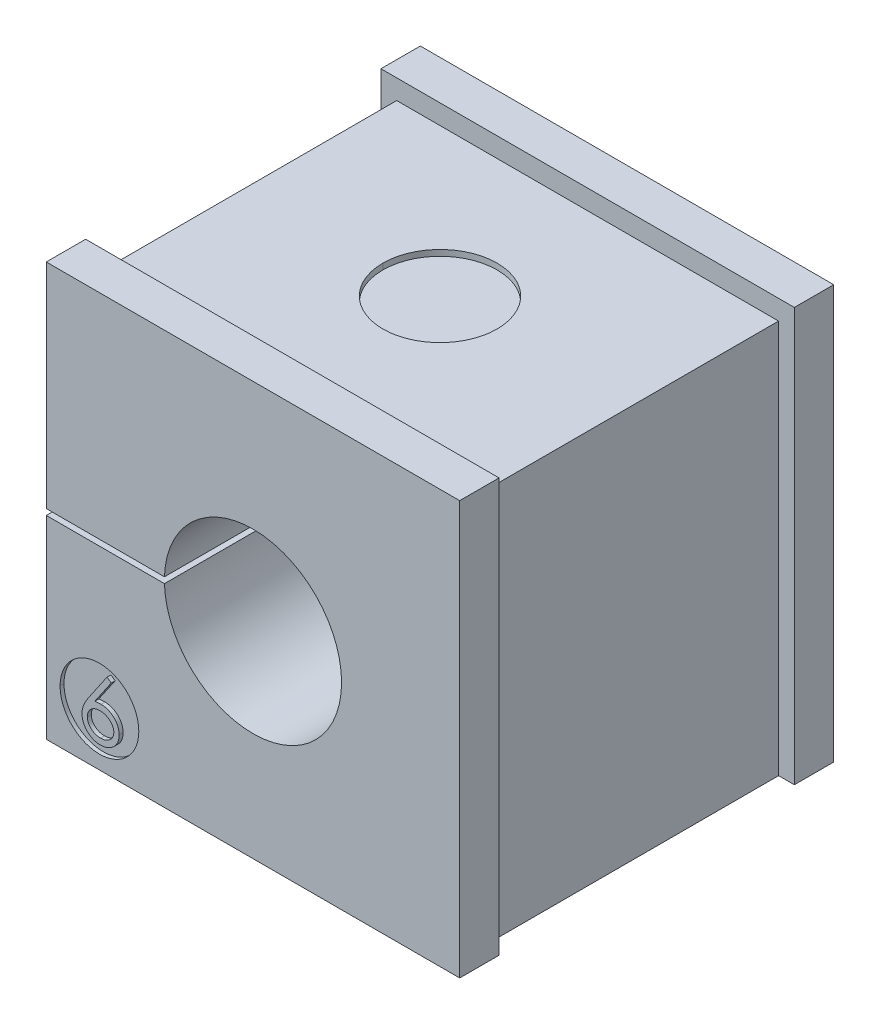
ISO-10303-21;
HEADER;
FILE_DESCRIPTION(('STEP AP214'),'2;1');
FILE_NAME('part.step','',(''),(''),'','','');
FILE_SCHEMA(('AUTOMOTIVE_DESIGN { 1 0 10303 214 1 1 1 1 }'));
ENDSEC;
DATA;
#1=APPLICATION_CONTEXT('core data for automotive mechanical design processes');
#2=APPLICATION_PROTOCOL_DEFINITION('international standard','automotive_design',2000,#1);
#3=PRODUCT_CONTEXT('',#1,'mechanical');
#4=PRODUCT('Part','Part','',(#3));
#5=PRODUCT_RELATED_PRODUCT_CATEGORY('part','',(#4));
#6=PRODUCT_DEFINITION_FORMATION('','',#4);
#7=PRODUCT_DEFINITION_CONTEXT('part definition',#1,'design');
#8=PRODUCT_DEFINITION('design','',#6,#7);
#9=PRODUCT_DEFINITION_SHAPE('','',#8);
#10=(LENGTH_UNIT() NAMED_UNIT(*) SI_UNIT(.MILLI.,.METRE.));
#11=(NAMED_UNIT(*) PLANE_ANGLE_UNIT() SI_UNIT($,.RADIAN.));
#12=(NAMED_UNIT(*) SI_UNIT($,.STERADIAN.) SOLID_ANGLE_UNIT());
#13=UNCERTAINTY_MEASURE_WITH_UNIT(LENGTH_MEASURE(1.E-05),#10,'distance_accuracy_value','');
#14=(GEOMETRIC_REPRESENTATION_CONTEXT(3) GLOBAL_UNCERTAINTY_ASSIGNED_CONTEXT((#13)) GLOBAL_UNIT_ASSIGNED_CONTEXT((#10,
#11,#12)) REPRESENTATION_CONTEXT('',''));
#15=CARTESIAN_POINT('',(0.,0.,0.));
#16=DIRECTION('',(0.,0.,1.));
#17=DIRECTION('',(1.,0.,0.));
#18=AXIS2_PLACEMENT_3D('',#15,#16,#17);
#19=CARTESIAN_POINT('',(2.7,-7.8,9.3));
#20=DIRECTION('',(0.,0.,1.));
#21=DIRECTION('',(1.,0.,0.));
#22=AXIS2_PLACEMENT_3D('',#19,#20,#21);
#23=PLANE('',#22);
#24=CARTESIAN_POINT('',(3.43076923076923,-8.47307692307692,9.3));
#25=CARTESIAN_POINT('',(3.43024930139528,-8.45280733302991,9.3));
#26=CARTESIAN_POINT('',(3.4292239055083,-8.41283199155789,9.3));
#27=CARTESIAN_POINT('',(3.41935106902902,-8.35409084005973,9.3));
#28=CARTESIAN_POINT('',(3.40279652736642,-8.29780249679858,9.3));
#29=CARTESIAN_POINT('',(3.38084511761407,-8.24348646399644,9.3));
#30=CARTESIAN_POINT('',(3.35138569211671,-8.19184545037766,9.3));
#31=CARTESIAN_POINT('',(3.31558397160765,-8.14261167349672,9.3));
#32=CARTESIAN_POINT('',(3.27427489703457,-8.0947786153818,9.3));
#33=CARTESIAN_POINT('',(3.22610467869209,-8.0510309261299,9.3));
#34=CARTESIAN_POINT('',(3.17437819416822,-8.0101932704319,9.3));
#35=CARTESIAN_POINT('',(3.11881844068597,-7.97457788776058,9.3));
#36=CARTESIAN_POINT('',(3.06054192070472,-7.94471329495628,9.3));
#37=CARTESIAN_POINT('',(2.99992280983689,-7.9196681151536,9.3));
#38=CARTESIAN_POINT('',(2.93650751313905,-7.90050645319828,9.3));
#39=CARTESIAN_POINT('',(2.870384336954,-7.88657660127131,9.3));
#40=CARTESIAN_POINT('',(2.80154137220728,-7.87892141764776,9.3));
#41=CARTESIAN_POINT('',(2.75490525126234,-7.87759558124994,9.3));
#42=CARTESIAN_POINT('',(2.73125,-7.87692307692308,9.3));
#43=(BOUNDED_CURVE() B_SPLINE_CURVE(3,(#24,#25,#26,#27,#28,#29,#30,#31,#32,#33,#34,#35,#36,#37,
#38,#39,#40,#41,#42),.UNSPECIFIED.,.F.,.F.) B_SPLINE_CURVE_WITH_KNOTS((4,1,1,1,1,1,1,1,1,1,1,1,
1,1,1,1,4),(0.,0.059554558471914,0.117452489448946,0.174484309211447,0.231792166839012,
0.289281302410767,0.348774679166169,0.410547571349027,0.474727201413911,0.539757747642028,
0.60412355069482,0.66839228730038,0.732042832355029,0.796688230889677,0.862871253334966,
0.930444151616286,1.),
.UNSPECIFIED.) CURVE() GEOMETRIC_REPRESENTATION_ITEM() RATIONAL_B_SPLINE_CURVE((1.,1.,1.,1.,1.,
1.,1.,1.,1.,1.,1.,1.,1.,1.,1.,1.,1.,1.,1.)) REPRESENTATION_ITEM(''));
#44=CARTESIAN_POINT('',(3.43076923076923,-8.47307692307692,9.3));
#45=VERTEX_POINT('',#44);
#46=CARTESIAN_POINT('',(2.73125,-7.87692307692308,9.3));
#47=VERTEX_POINT('',#46);
#48=EDGE_CURVE('E220',#45,#47,#43,.T.);
#49=ORIENTED_EDGE('',*,*,#48,.T.);
#50=CARTESIAN_POINT('',(2.73125,-7.87692307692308,9.3));
#51=CARTESIAN_POINT('',(2.70739284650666,-7.87757618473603,9.3));
#52=CARTESIAN_POINT('',(2.6609510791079,-7.87884756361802,9.3));
#53=CARTESIAN_POINT('',(2.5929054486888,-7.88655104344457,9.3));
#54=CARTESIAN_POINT('',(2.52871330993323,-7.90031045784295,9.3));
#55=CARTESIAN_POINT('',(2.46796151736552,-7.91974067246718,9.3));
#56=CARTESIAN_POINT('',(2.41072361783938,-7.94435487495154,9.3));
#57=CARTESIAN_POINT('',(2.35698158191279,-7.97435130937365,9.3));
#58=CARTESIAN_POINT('',(2.30728436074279,-8.01038713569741,9.3));
#59=CARTESIAN_POINT('',(2.26145502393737,-8.05089212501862,9.3));
#60=CARTESIAN_POINT('',(2.21986350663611,-8.09528398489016,9.3));
#61=CARTESIAN_POINT('',(2.18400203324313,-8.14284573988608,9.3));
#62=CARTESIAN_POINT('',(2.15295248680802,-8.19209981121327,9.3));
#63=CARTESIAN_POINT('',(2.12818189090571,-8.24405450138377,9.3));
#64=CARTESIAN_POINT('',(2.10821932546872,-8.29785989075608,9.3));
#65=CARTESIAN_POINT('',(2.09429014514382,-8.35429410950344,9.3));
#66=CARTESIAN_POINT('',(2.08659686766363,-8.41296751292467,9.3));
#67=CARTESIAN_POINT('',(2.08528304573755,-8.45282304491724,9.3));
#68=CARTESIAN_POINT('',(2.08461538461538,-8.47307692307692,9.3));
#69=(BOUNDED_CURVE() B_SPLINE_CURVE(3,(#50,#51,#52,#53,#54,#55,#56,#57,#58,#59,#60,#61,#62,#63,
#64,#65,#66,#67,#68),.UNSPECIFIED.,.F.,.F.) B_SPLINE_CURVE_WITH_KNOTS((4,1,1,1,1,1,1,1,1,1,1,1,
1,1,1,1,4),(0.,0.0727329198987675,0.141586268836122,0.208419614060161,0.27253623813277,
0.335721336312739,0.398059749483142,0.45974872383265,0.522480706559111,0.584266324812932,
0.644845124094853,0.703814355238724,0.761443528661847,0.819981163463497,0.878483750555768,
0.938247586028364,1.),
.UNSPECIFIED.) CURVE() GEOMETRIC_REPRESENTATION_ITEM() RATIONAL_B_SPLINE_CURVE((1.,1.,1.,1.,1.,
1.,1.,1.,1.,1.,1.,1.,1.,1.,1.,1.,1.,1.,1.)) REPRESENTATION_ITEM(''));
#70=CARTESIAN_POINT('',(2.08461538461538,-8.47307692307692,9.3));
#71=VERTEX_POINT('',#70);
#72=EDGE_CURVE('E18',#47,#71,#69,.T.);
#73=ORIENTED_EDGE('',*,*,#72,.T.);
#74=CARTESIAN_POINT('',(2.08461538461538,-8.47307692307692,9.3));
#75=CARTESIAN_POINT('',(2.08518877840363,-8.49333981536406,9.3));
#76=CARTESIAN_POINT('',(2.08631872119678,-8.53327033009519,9.3));
#77=CARTESIAN_POINT('',(2.09540229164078,-8.59202262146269,9.3));
#78=CARTESIAN_POINT('',(2.11133423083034,-8.64834835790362,9.3));
#79=CARTESIAN_POINT('',(2.13294156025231,-8.70261659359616,9.3));
#80=CARTESIAN_POINT('',(2.16081294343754,-8.7545847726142,9.3));
#81=CARTESIAN_POINT('',(2.19470856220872,-8.80410217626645,9.3));
#82=CARTESIAN_POINT('',(2.23484752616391,-8.85135096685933,9.3));
#83=CARTESIAN_POINT('',(2.28058398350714,-8.89573913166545,9.3));
#84=CARTESIAN_POINT('',(2.33077170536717,-8.93652727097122,9.3));
#85=CARTESIAN_POINT('',(2.38442078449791,-8.9719248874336,9.3));
#86=CARTESIAN_POINT('',(2.44035499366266,-9.00235042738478,9.3));
#87=CARTESIAN_POINT('',(2.49920993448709,-9.02617061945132,9.3));
#88=CARTESIAN_POINT('',(2.56018684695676,-9.04572418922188,9.3));
#89=CARTESIAN_POINT('',(2.62395639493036,-9.05955674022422,9.3));
#90=CARTESIAN_POINT('',(2.69059597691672,-9.0672653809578,9.3));
#91=CARTESIAN_POINT('',(2.73583817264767,-9.06856729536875,9.3));
#92=CARTESIAN_POINT('',(2.75889423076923,-9.06923076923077,9.3));
#93=(BOUNDED_CURVE() B_SPLINE_CURVE(3,(#74,#75,#76,#77,#78,#79,#80,#81,#82,#83,#84,#85,#86,#87,
#88,#89,#90,#91,#92),.UNSPECIFIED.,.F.,.F.) B_SPLINE_CURVE_WITH_KNOTS((4,1,1,1,1,1,1,1,1,1,1,1,
1,1,1,1,4),(0.,0.0607377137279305,0.119691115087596,0.177691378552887,0.235912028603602,
0.294490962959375,0.354131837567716,0.41550179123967,0.480063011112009,0.544975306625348,
0.609110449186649,0.672530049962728,0.73555020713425,0.799185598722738,0.864333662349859,
0.930862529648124,1.),
.UNSPECIFIED.) CURVE() GEOMETRIC_REPRESENTATION_ITEM() RATIONAL_B_SPLINE_CURVE((1.,1.,1.,1.,1.,
1.,1.,1.,1.,1.,1.,1.,1.,1.,1.,1.,1.,1.,1.)) REPRESENTATION_ITEM(''));
#94=CARTESIAN_POINT('',(2.75889423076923,-9.06923076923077,9.3));
#95=VERTEX_POINT('',#94);
#96=EDGE_CURVE('E263',#71,#95,#93,.T.);
#97=ORIENTED_EDGE('',*,*,#96,.T.);
#98=CARTESIAN_POINT('',(2.75889423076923,-9.06923076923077,9.3));
#99=CARTESIAN_POINT('',(2.78174982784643,-9.06856632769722,9.3));
#100=CARTESIAN_POINT('',(2.82659232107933,-9.06726269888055,9.3));
#101=CARTESIAN_POINT('',(2.89263868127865,-9.05957017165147,9.3));
#102=CARTESIAN_POINT('',(2.95597998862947,-9.04563522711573,9.3));
#103=CARTESIAN_POINT('',(3.01676871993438,-9.02616100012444,9.3));
#104=CARTESIAN_POINT('',(3.07549952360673,-9.0024830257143,9.3));
#105=CARTESIAN_POINT('',(3.13098848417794,-8.97192560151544,9.3));
#106=CARTESIAN_POINT('',(3.18407856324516,-8.93633831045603,9.3));
#107=CARTESIAN_POINT('',(3.23425177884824,-8.89579166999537,9.3));
#108=CARTESIAN_POINT('',(3.2798881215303,-8.85113758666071,9.3));
#109=CARTESIAN_POINT('',(3.32072260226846,-8.80431270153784,9.3));
#110=CARTESIAN_POINT('',(3.3545405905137,-8.7545580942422,9.3));
#111=CARTESIAN_POINT('',(3.38245126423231,-8.70262363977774,9.3));
#112=CARTESIAN_POINT('',(3.40404820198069,-8.64834648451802,9.3));
#113=CARTESIAN_POINT('',(3.41998291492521,-8.59202312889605,9.3));
#114=CARTESIAN_POINT('',(3.42906574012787,-8.53327019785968,9.3));
#115=CARTESIAN_POINT('',(3.43019578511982,-8.49333977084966,9.3));
#116=CARTESIAN_POINT('',(3.43076923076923,-8.47307692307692,9.3));
#117=(BOUNDED_CURVE() B_SPLINE_CURVE(3,(#98,#99,#100,#101,#102,#103,#104,#105,#106,#107,#108,
#109,#110,#111,#112,#113,#114,#115,#116),.UNSPECIFIED.,.F.,.F.) B_SPLINE_CURVE_WITH_KNOTS((4,1,
1,1,1,1,1,1,1,1,1,1,1,1,1,1,4),(0.,0.0687038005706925,0.134796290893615,0.199514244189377,
0.263304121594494,0.326477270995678,0.389521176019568,0.453311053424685,0.51838093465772,
0.583098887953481,0.645008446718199,0.704794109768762,0.763515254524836,0.821877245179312,
0.880018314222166,0.939114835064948,1.),
.UNSPECIFIED.) CURVE() GEOMETRIC_REPRESENTATION_ITEM() RATIONAL_B_SPLINE_CURVE((1.,1.,1.,1.,1.,
1.,1.,1.,1.,1.,1.,1.,1.,1.,1.,1.,1.,1.,1.)) REPRESENTATION_ITEM(''));
#118=EDGE_CURVE('E9',#95,#45,#117,.T.);
#119=ORIENTED_EDGE('',*,*,#118,.T.);
#120=EDGE_LOOP('',(#49,#73,#97,#119));
#121=FACE_BOUND('',#120,.T.);
#122=ADVANCED_FACE('F15',(#121),#23,.T.);
#123=CARTESIAN_POINT('',(2.75889423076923,-9.06923076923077,9.5));
#124=CARTESIAN_POINT('',(2.75889423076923,-9.06923076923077,9.3));
#125=CARTESIAN_POINT('',(2.78174982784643,-9.06856632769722,9.5));
#126=CARTESIAN_POINT('',(2.78174982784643,-9.06856632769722,9.3));
#127=CARTESIAN_POINT('',(2.82659232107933,-9.06726269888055,9.5));
#128=CARTESIAN_POINT('',(2.82659232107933,-9.06726269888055,9.3));
#129=CARTESIAN_POINT('',(2.89263868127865,-9.05957017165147,9.5));
#130=CARTESIAN_POINT('',(2.89263868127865,-9.05957017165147,9.3));
#131=CARTESIAN_POINT('',(2.95597998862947,-9.04563522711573,9.5));
#132=CARTESIAN_POINT('',(2.95597998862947,-9.04563522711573,9.3));
#133=CARTESIAN_POINT('',(3.01676871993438,-9.02616100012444,9.5));
#134=CARTESIAN_POINT('',(3.01676871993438,-9.02616100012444,9.3));
#135=CARTESIAN_POINT('',(3.07549952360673,-9.0024830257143,9.5));
#136=CARTESIAN_POINT('',(3.07549952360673,-9.0024830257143,9.3));
#137=CARTESIAN_POINT('',(3.13098848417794,-8.97192560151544,9.5));
#138=CARTESIAN_POINT('',(3.13098848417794,-8.97192560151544,9.3));
#139=CARTESIAN_POINT('',(3.18407856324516,-8.93633831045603,9.5));
#140=CARTESIAN_POINT('',(3.18407856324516,-8.93633831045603,9.3));
#141=CARTESIAN_POINT('',(3.23425177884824,-8.89579166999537,9.5));
#142=CARTESIAN_POINT('',(3.23425177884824,-8.89579166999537,9.3));
#143=CARTESIAN_POINT('',(3.2798881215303,-8.85113758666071,9.5));
#144=CARTESIAN_POINT('',(3.2798881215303,-8.85113758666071,9.3));
#145=CARTESIAN_POINT('',(3.32072260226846,-8.80431270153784,9.5));
#146=CARTESIAN_POINT('',(3.32072260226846,-8.80431270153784,9.3));
#147=CARTESIAN_POINT('',(3.3545405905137,-8.7545580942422,9.5));
#148=CARTESIAN_POINT('',(3.3545405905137,-8.7545580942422,9.3));
#149=CARTESIAN_POINT('',(3.38245126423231,-8.70262363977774,9.5));
#150=CARTESIAN_POINT('',(3.38245126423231,-8.70262363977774,9.3));
#151=CARTESIAN_POINT('',(3.40404820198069,-8.64834648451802,9.5));
#152=CARTESIAN_POINT('',(3.40404820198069,-8.64834648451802,9.3));
#153=CARTESIAN_POINT('',(3.41998291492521,-8.59202312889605,9.5));
#154=CARTESIAN_POINT('',(3.41998291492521,-8.59202312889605,9.3));
#155=CARTESIAN_POINT('',(3.42906574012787,-8.53327019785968,9.5));
#156=CARTESIAN_POINT('',(3.42906574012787,-8.53327019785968,9.3));
#157=CARTESIAN_POINT('',(3.43019578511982,-8.49333977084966,9.5));
#158=CARTESIAN_POINT('',(3.43019578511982,-8.49333977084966,9.3));
#159=CARTESIAN_POINT('',(3.43076923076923,-8.47307692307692,9.5));
#160=CARTESIAN_POINT('',(3.43076923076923,-8.47307692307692,9.3));
#161=(BOUNDED_SURFACE() B_SPLINE_SURFACE(3,1,((#123,#124),(#125,#126),(#127,#128),(#129,#130),
(#131,#132),(#133,#134),(#135,#136),(#137,#138),(#139,#140),(#141,#142),(#143,#144),(#145,#146),
(#147,#148),(#149,#150),(#151,#152),(#153,#154),(#155,#156),(#157,#158),(#159,#160)),
.UNSPECIFIED.,.F.,.F.,.F.) B_SPLINE_SURFACE_WITH_KNOTS((4,1,1,1,1,1,1,1,1,1,1,1,1,1,1,1,4),(2,
2),(0.,0.0687038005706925,0.134796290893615,0.199514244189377,0.263304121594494,
0.326477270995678,0.389521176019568,0.453311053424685,0.51838093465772,0.583098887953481,
0.645008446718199,0.704794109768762,0.763515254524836,0.821877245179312,0.880018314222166,
0.939114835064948,1.),(0.,1.),
.UNSPECIFIED.) GEOMETRIC_REPRESENTATION_ITEM() RATIONAL_B_SPLINE_SURFACE(((1.,1.),(1.,1.),(1.,
1.),(1.,1.),(1.,1.),(1.,1.),(1.,1.),(1.,1.),(1.,1.),(1.,1.),(1.,1.),(1.,1.),(1.,1.),(1.,1.),(1.,
1.),(1.,1.),(1.,1.),(1.,1.),(1.,1.))) REPRESENTATION_ITEM('') SURFACE());
#162=DIRECTION('',(0.,0.,-1.));
#163=VECTOR('',#162,1.);
#164=CARTESIAN_POINT('',(2.75889423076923,-9.06923076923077,9.5));
#165=LINE('',#164,#163);
#166=CARTESIAN_POINT('',(2.75889423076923,-9.06923076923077,9.5));
#167=VERTEX_POINT('',#166);
#168=EDGE_CURVE('E27',#167,#95,#165,.T.);
#169=CARTESIAN_POINT('',(2.75889423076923,-9.06923076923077,9.5));
#170=CARTESIAN_POINT('',(2.78174982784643,-9.06856632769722,9.5));
#171=CARTESIAN_POINT('',(2.82659232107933,-9.06726269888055,9.5));
#172=CARTESIAN_POINT('',(2.89263868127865,-9.05957017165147,9.5));
#173=CARTESIAN_POINT('',(2.95597998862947,-9.04563522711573,9.5));
#174=CARTESIAN_POINT('',(3.01676871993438,-9.02616100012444,9.5));
#175=CARTESIAN_POINT('',(3.07549952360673,-9.0024830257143,9.5));
#176=CARTESIAN_POINT('',(3.13098848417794,-8.97192560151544,9.5));
#177=CARTESIAN_POINT('',(3.18407856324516,-8.93633831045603,9.5));
#178=CARTESIAN_POINT('',(3.23425177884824,-8.89579166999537,9.5));
#179=CARTESIAN_POINT('',(3.2798881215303,-8.85113758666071,9.5));
#180=CARTESIAN_POINT('',(3.32072260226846,-8.80431270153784,9.5));
#181=CARTESIAN_POINT('',(3.3545405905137,-8.7545580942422,9.5));
#182=CARTESIAN_POINT('',(3.38245126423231,-8.70262363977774,9.5));
#183=CARTESIAN_POINT('',(3.40404820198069,-8.64834648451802,9.5));
#184=CARTESIAN_POINT('',(3.41998291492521,-8.59202312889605,9.5));
#185=CARTESIAN_POINT('',(3.42906574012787,-8.53327019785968,9.5));
#186=CARTESIAN_POINT('',(3.43019578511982,-8.49333977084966,9.5));
#187=CARTESIAN_POINT('',(3.43076923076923,-8.47307692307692,9.5));
#188=(BOUNDED_CURVE() B_SPLINE_CURVE(3,(#169,#170,#171,#172,#173,#174,#175,#176,#177,#178,#179,
#180,#181,#182,#183,#184,#185,#186,#187),.UNSPECIFIED.,.F.,.F.) B_SPLINE_CURVE_WITH_KNOTS((4,1,
1,1,1,1,1,1,1,1,1,1,1,1,1,1,4),(0.,0.0687038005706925,0.134796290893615,0.199514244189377,
0.263304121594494,0.326477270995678,0.389521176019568,0.453311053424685,0.51838093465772,
0.583098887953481,0.645008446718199,0.704794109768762,0.763515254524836,0.821877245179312,
0.880018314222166,0.939114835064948,1.),
.UNSPECIFIED.) CURVE() GEOMETRIC_REPRESENTATION_ITEM() RATIONAL_B_SPLINE_CURVE((1.,1.,1.,1.,1.,
1.,1.,1.,1.,1.,1.,1.,1.,1.,1.,1.,1.,1.,1.)) REPRESENTATION_ITEM(''));
#189=CARTESIAN_POINT('',(3.43076923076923,-8.47307692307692,9.5));
#190=VERTEX_POINT('',#189);
#191=EDGE_CURVE('E365',#167,#190,#188,.T.);
#192=DIRECTION('',(0.,0.,-1.));
#193=VECTOR('',#192,1.);
#194=CARTESIAN_POINT('',(3.43076923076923,-8.47307692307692,9.5));
#195=LINE('',#194,#193);
#196=EDGE_CURVE('E225',#190,#45,#195,.T.);
#197=ORIENTED_EDGE('',*,*,#118,.F.);
#198=ORIENTED_EDGE('',*,*,#168,.F.);
#199=ORIENTED_EDGE('',*,*,#191,.T.);
#200=ORIENTED_EDGE('',*,*,#196,.T.);
#201=EDGE_LOOP('',(#197,#198,#199,#200));
#202=FACE_BOUND('',#201,.T.);
#203=ADVANCED_FACE('F916',(#202),#161,.T.);
#204=CARTESIAN_POINT('',(2.08461538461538,-8.47307692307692,9.5));
#205=CARTESIAN_POINT('',(2.08461538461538,-8.47307692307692,9.3));
#206=CARTESIAN_POINT('',(2.08518877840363,-8.49333981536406,9.5));
#207=CARTESIAN_POINT('',(2.08518877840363,-8.49333981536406,9.3));
#208=CARTESIAN_POINT('',(2.08631872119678,-8.53327033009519,9.5));
#209=CARTESIAN_POINT('',(2.08631872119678,-8.53327033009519,9.3));
#210=CARTESIAN_POINT('',(2.09540229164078,-8.59202262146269,9.5));
#211=CARTESIAN_POINT('',(2.09540229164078,-8.59202262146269,9.3));
#212=CARTESIAN_POINT('',(2.11133423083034,-8.64834835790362,9.5));
#213=CARTESIAN_POINT('',(2.11133423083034,-8.64834835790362,9.3));
#214=CARTESIAN_POINT('',(2.13294156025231,-8.70261659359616,9.5));
#215=CARTESIAN_POINT('',(2.13294156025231,-8.70261659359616,9.3));
#216=CARTESIAN_POINT('',(2.16081294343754,-8.7545847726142,9.5));
#217=CARTESIAN_POINT('',(2.16081294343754,-8.7545847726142,9.3));
#218=CARTESIAN_POINT('',(2.19470856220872,-8.80410217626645,9.5));
#219=CARTESIAN_POINT('',(2.19470856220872,-8.80410217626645,9.3));
#220=CARTESIAN_POINT('',(2.23484752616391,-8.85135096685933,9.5));
#221=CARTESIAN_POINT('',(2.23484752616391,-8.85135096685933,9.3));
#222=CARTESIAN_POINT('',(2.28058398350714,-8.89573913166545,9.5));
#223=CARTESIAN_POINT('',(2.28058398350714,-8.89573913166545,9.3));
#224=CARTESIAN_POINT('',(2.33077170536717,-8.93652727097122,9.5));
#225=CARTESIAN_POINT('',(2.33077170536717,-8.93652727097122,9.3));
#226=CARTESIAN_POINT('',(2.38442078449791,-8.9719248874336,9.5));
#227=CARTESIAN_POINT('',(2.38442078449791,-8.9719248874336,9.3));
#228=CARTESIAN_POINT('',(2.44035499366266,-9.00235042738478,9.5));
#229=CARTESIAN_POINT('',(2.44035499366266,-9.00235042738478,9.3));
#230=CARTESIAN_POINT('',(2.49920993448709,-9.02617061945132,9.5));
#231=CARTESIAN_POINT('',(2.49920993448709,-9.02617061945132,9.3));
#232=CARTESIAN_POINT('',(2.56018684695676,-9.04572418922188,9.5));
#233=CARTESIAN_POINT('',(2.56018684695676,-9.04572418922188,9.3));
#234=CARTESIAN_POINT('',(2.62395639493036,-9.05955674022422,9.5));
#235=CARTESIAN_POINT('',(2.62395639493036,-9.05955674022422,9.3));
#236=CARTESIAN_POINT('',(2.69059597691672,-9.0672653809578,9.5));
#237=CARTESIAN_POINT('',(2.69059597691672,-9.0672653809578,9.3));
#238=CARTESIAN_POINT('',(2.73583817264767,-9.06856729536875,9.5));
#239=CARTESIAN_POINT('',(2.73583817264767,-9.06856729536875,9.3));
#240=CARTESIAN_POINT('',(2.75889423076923,-9.06923076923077,9.5));
#241=CARTESIAN_POINT('',(2.75889423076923,-9.06923076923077,9.3));
#242=(BOUNDED_SURFACE() B_SPLINE_SURFACE(3,1,((#204,#205),(#206,#207),(#208,#209),(#210,#211),
(#212,#213),(#214,#215),(#216,#217),(#218,#219),(#220,#221),(#222,#223),(#224,#225),(#226,#227),
(#228,#229),(#230,#231),(#232,#233),(#234,#235),(#236,#237),(#238,#239),(#240,#241)),
.UNSPECIFIED.,.F.,.F.,.F.) B_SPLINE_SURFACE_WITH_KNOTS((4,1,1,1,1,1,1,1,1,1,1,1,1,1,1,1,4),(2,
2),(0.,0.0607377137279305,0.119691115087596,0.177691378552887,0.235912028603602,
0.294490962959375,0.354131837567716,0.41550179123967,0.480063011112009,0.544975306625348,
0.609110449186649,0.672530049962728,0.73555020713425,0.799185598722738,0.864333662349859,
0.930862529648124,1.),(0.,1.),
.UNSPECIFIED.) GEOMETRIC_REPRESENTATION_ITEM() RATIONAL_B_SPLINE_SURFACE(((1.,1.),(1.,1.),(1.,
1.),(1.,1.),(1.,1.),(1.,1.),(1.,1.),(1.,1.),(1.,1.),(1.,1.),(1.,1.),(1.,1.),(1.,1.),(1.,1.),(1.,
1.),(1.,1.),(1.,1.),(1.,1.),(1.,1.))) REPRESENTATION_ITEM('') SURFACE());
#243=DIRECTION('',(0.,0.,-1.));
#244=VECTOR('',#243,1.);
#245=CARTESIAN_POINT('',(2.08461538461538,-8.47307692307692,9.5));
#246=LINE('',#245,#244);
#247=CARTESIAN_POINT('',(2.08461538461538,-8.47307692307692,9.5));
#248=VERTEX_POINT('',#247);
#249=EDGE_CURVE('E212',#248,#71,#246,.T.);
#250=CARTESIAN_POINT('',(2.08461538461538,-8.47307692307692,9.5));
#251=CARTESIAN_POINT('',(2.08518877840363,-8.49333981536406,9.5));
#252=CARTESIAN_POINT('',(2.08631872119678,-8.53327033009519,9.5));
#253=CARTESIAN_POINT('',(2.09540229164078,-8.59202262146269,9.5));
#254=CARTESIAN_POINT('',(2.11133423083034,-8.64834835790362,9.5));
#255=CARTESIAN_POINT('',(2.13294156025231,-8.70261659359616,9.5));
#256=CARTESIAN_POINT('',(2.16081294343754,-8.7545847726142,9.5));
#257=CARTESIAN_POINT('',(2.19470856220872,-8.80410217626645,9.5));
#258=CARTESIAN_POINT('',(2.23484752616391,-8.85135096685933,9.5));
#259=CARTESIAN_POINT('',(2.28058398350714,-8.89573913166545,9.5));
#260=CARTESIAN_POINT('',(2.33077170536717,-8.93652727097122,9.5));
#261=CARTESIAN_POINT('',(2.38442078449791,-8.9719248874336,9.5));
#262=CARTESIAN_POINT('',(2.44035499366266,-9.00235042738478,9.5));
#263=CARTESIAN_POINT('',(2.49920993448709,-9.02617061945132,9.5));
#264=CARTESIAN_POINT('',(2.56018684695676,-9.04572418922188,9.5));
#265=CARTESIAN_POINT('',(2.62395639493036,-9.05955674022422,9.5));
#266=CARTESIAN_POINT('',(2.69059597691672,-9.0672653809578,9.5));
#267=CARTESIAN_POINT('',(2.73583817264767,-9.06856729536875,9.5));
#268=CARTESIAN_POINT('',(2.75889423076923,-9.06923076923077,9.5));
#269=(BOUNDED_CURVE() B_SPLINE_CURVE(3,(#250,#251,#252,#253,#254,#255,#256,#257,#258,#259,#260,
#261,#262,#263,#264,#265,#266,#267,#268),.UNSPECIFIED.,.F.,.F.) B_SPLINE_CURVE_WITH_KNOTS((4,1,
1,1,1,1,1,1,1,1,1,1,1,1,1,1,4),(0.,0.0607377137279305,0.119691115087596,0.177691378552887,
0.235912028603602,0.294490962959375,0.354131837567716,0.41550179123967,0.480063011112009,
0.544975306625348,0.609110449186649,0.672530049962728,0.73555020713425,0.799185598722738,
0.864333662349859,0.930862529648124,1.),
.UNSPECIFIED.) CURVE() GEOMETRIC_REPRESENTATION_ITEM() RATIONAL_B_SPLINE_CURVE((1.,1.,1.,1.,1.,
1.,1.,1.,1.,1.,1.,1.,1.,1.,1.,1.,1.,1.,1.)) REPRESENTATION_ITEM(''));
#270=EDGE_CURVE('E322',#248,#167,#269,.T.);
#271=ORIENTED_EDGE('',*,*,#96,.F.);
#272=ORIENTED_EDGE('',*,*,#249,.F.);
#273=ORIENTED_EDGE('',*,*,#270,.T.);
#274=ORIENTED_EDGE('',*,*,#168,.T.);
#275=EDGE_LOOP('',(#271,#272,#273,#274));
#276=FACE_BOUND('',#275,.T.);
#277=ADVANCED_FACE('F920',(#276),#242,.T.);
#278=CARTESIAN_POINT('',(2.73125,-7.87692307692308,9.5));
#279=CARTESIAN_POINT('',(2.73125,-7.87692307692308,9.3));
#280=CARTESIAN_POINT('',(2.70739284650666,-7.87757618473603,9.5));
#281=CARTESIAN_POINT('',(2.70739284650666,-7.87757618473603,9.3));
#282=CARTESIAN_POINT('',(2.6609510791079,-7.87884756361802,9.5));
#283=CARTESIAN_POINT('',(2.6609510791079,-7.87884756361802,9.3));
#284=CARTESIAN_POINT('',(2.5929054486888,-7.88655104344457,9.5));
#285=CARTESIAN_POINT('',(2.5929054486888,-7.88655104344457,9.3));
#286=CARTESIAN_POINT('',(2.52871330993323,-7.90031045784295,9.5));
#287=CARTESIAN_POINT('',(2.52871330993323,-7.90031045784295,9.3));
#288=CARTESIAN_POINT('',(2.46796151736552,-7.91974067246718,9.5));
#289=CARTESIAN_POINT('',(2.46796151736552,-7.91974067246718,9.3));
#290=CARTESIAN_POINT('',(2.41072361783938,-7.94435487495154,9.5));
#291=CARTESIAN_POINT('',(2.41072361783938,-7.94435487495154,9.3));
#292=CARTESIAN_POINT('',(2.35698158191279,-7.97435130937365,9.5));
#293=CARTESIAN_POINT('',(2.35698158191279,-7.97435130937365,9.3));
#294=CARTESIAN_POINT('',(2.30728436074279,-8.01038713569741,9.5));
#295=CARTESIAN_POINT('',(2.30728436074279,-8.01038713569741,9.3));
#296=CARTESIAN_POINT('',(2.26145502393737,-8.05089212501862,9.5));
#297=CARTESIAN_POINT('',(2.26145502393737,-8.05089212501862,9.3));
#298=CARTESIAN_POINT('',(2.21986350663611,-8.09528398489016,9.5));
#299=CARTESIAN_POINT('',(2.21986350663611,-8.09528398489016,9.3));
#300=CARTESIAN_POINT('',(2.18400203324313,-8.14284573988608,9.5));
#301=CARTESIAN_POINT('',(2.18400203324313,-8.14284573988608,9.3));
#302=CARTESIAN_POINT('',(2.15295248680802,-8.19209981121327,9.5));
#303=CARTESIAN_POINT('',(2.15295248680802,-8.19209981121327,9.3));
#304=CARTESIAN_POINT('',(2.12818189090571,-8.24405450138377,9.5));
#305=CARTESIAN_POINT('',(2.12818189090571,-8.24405450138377,9.3));
#306=CARTESIAN_POINT('',(2.10821932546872,-8.29785989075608,9.5));
#307=CARTESIAN_POINT('',(2.10821932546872,-8.29785989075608,9.3));
#308=CARTESIAN_POINT('',(2.09429014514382,-8.35429410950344,9.5));
#309=CARTESIAN_POINT('',(2.09429014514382,-8.35429410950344,9.3));
#310=CARTESIAN_POINT('',(2.08659686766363,-8.41296751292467,9.5));
#311=CARTESIAN_POINT('',(2.08659686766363,-8.41296751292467,9.3));
#312=CARTESIAN_POINT('',(2.08528304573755,-8.45282304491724,9.5));
#313=CARTESIAN_POINT('',(2.08528304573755,-8.45282304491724,9.3));
#314=CARTESIAN_POINT('',(2.08461538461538,-8.47307692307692,9.5));
#315=CARTESIAN_POINT('',(2.08461538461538,-8.47307692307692,9.3));
#316=(BOUNDED_SURFACE() B_SPLINE_SURFACE(3,1,((#278,#279),(#280,#281),(#282,#283),(#284,#285),
(#286,#287),(#288,#289),(#290,#291),(#292,#293),(#294,#295),(#296,#297),(#298,#299),(#300,#301),
(#302,#303),(#304,#305),(#306,#307),(#308,#309),(#310,#311),(#312,#313),(#314,#315)),
.UNSPECIFIED.,.F.,.F.,.F.) B_SPLINE_SURFACE_WITH_KNOTS((4,1,1,1,1,1,1,1,1,1,1,1,1,1,1,1,4),(2,
2),(0.,0.0727329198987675,0.141586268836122,0.208419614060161,0.27253623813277,
0.335721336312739,0.398059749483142,0.45974872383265,0.522480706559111,0.584266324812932,
0.644845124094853,0.703814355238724,0.761443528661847,0.819981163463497,0.878483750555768,
0.938247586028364,1.),(0.,1.),
.UNSPECIFIED.) GEOMETRIC_REPRESENTATION_ITEM() RATIONAL_B_SPLINE_SURFACE(((1.,1.),(1.,1.),(1.,
1.),(1.,1.),(1.,1.),(1.,1.),(1.,1.),(1.,1.),(1.,1.),(1.,1.),(1.,1.),(1.,1.),(1.,1.),(1.,1.),(1.,
1.),(1.,1.),(1.,1.),(1.,1.),(1.,1.))) REPRESENTATION_ITEM('') SURFACE());
#317=DIRECTION('',(0.,0.,-1.));
#318=VECTOR('',#317,1.);
#319=CARTESIAN_POINT('',(2.73125,-7.87692307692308,9.5));
#320=LINE('',#319,#318);
#321=CARTESIAN_POINT('',(2.73125,-7.87692307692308,9.5));
#322=VERTEX_POINT('',#321);
#323=EDGE_CURVE('E209',#322,#47,#320,.T.);
#324=CARTESIAN_POINT('',(2.73125,-7.87692307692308,9.5));
#325=CARTESIAN_POINT('',(2.70739284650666,-7.87757618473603,9.5));
#326=CARTESIAN_POINT('',(2.6609510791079,-7.87884756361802,9.5));
#327=CARTESIAN_POINT('',(2.5929054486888,-7.88655104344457,9.5));
#328=CARTESIAN_POINT('',(2.52871330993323,-7.90031045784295,9.5));
#329=CARTESIAN_POINT('',(2.46796151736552,-7.91974067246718,9.5));
#330=CARTESIAN_POINT('',(2.41072361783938,-7.94435487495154,9.5));
#331=CARTESIAN_POINT('',(2.35698158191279,-7.97435130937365,9.5));
#332=CARTESIAN_POINT('',(2.30728436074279,-8.01038713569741,9.5));
#333=CARTESIAN_POINT('',(2.26145502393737,-8.05089212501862,9.5));
#334=CARTESIAN_POINT('',(2.21986350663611,-8.09528398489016,9.5));
#335=CARTESIAN_POINT('',(2.18400203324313,-8.14284573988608,9.5));
#336=CARTESIAN_POINT('',(2.15295248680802,-8.19209981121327,9.5));
#337=CARTESIAN_POINT('',(2.12818189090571,-8.24405450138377,9.5));
#338=CARTESIAN_POINT('',(2.10821932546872,-8.29785989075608,9.5));
#339=CARTESIAN_POINT('',(2.09429014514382,-8.35429410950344,9.5));
#340=CARTESIAN_POINT('',(2.08659686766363,-8.41296751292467,9.5));
#341=CARTESIAN_POINT('',(2.08528304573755,-8.45282304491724,9.5));
#342=CARTESIAN_POINT('',(2.08461538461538,-8.47307692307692,9.5));
#343=(BOUNDED_CURVE() B_SPLINE_CURVE(3,(#324,#325,#326,#327,#328,#329,#330,#331,#332,#333,#334,
#335,#336,#337,#338,#339,#340,#341,#342),.UNSPECIFIED.,.F.,.F.) B_SPLINE_CURVE_WITH_KNOTS((4,1,
1,1,1,1,1,1,1,1,1,1,1,1,1,1,4),(0.,0.0727329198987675,0.141586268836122,0.208419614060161,
0.27253623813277,0.335721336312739,0.398059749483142,0.45974872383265,0.522480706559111,
0.584266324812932,0.644845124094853,0.703814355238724,0.761443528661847,0.819981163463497,
0.878483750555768,0.938247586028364,1.),
.UNSPECIFIED.) CURVE() GEOMETRIC_REPRESENTATION_ITEM() RATIONAL_B_SPLINE_CURVE((1.,1.,1.,1.,1.,
1.,1.,1.,1.,1.,1.,1.,1.,1.,1.,1.,1.,1.,1.)) REPRESENTATION_ITEM(''));
#344=EDGE_CURVE('E317',#322,#248,#343,.T.);
#345=ORIENTED_EDGE('',*,*,#72,.F.);
#346=ORIENTED_EDGE('',*,*,#323,.F.);
#347=ORIENTED_EDGE('',*,*,#344,.T.);
#348=ORIENTED_EDGE('',*,*,#249,.T.);
#349=EDGE_LOOP('',(#345,#346,#347,#348));
#350=FACE_BOUND('',#349,.T.);
#351=ADVANCED_FACE('F207',(#350),#316,.T.);
#352=CARTESIAN_POINT('',(3.43076923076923,-8.47307692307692,9.5));
#353=CARTESIAN_POINT('',(3.43076923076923,-8.47307692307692,9.3));
#354=CARTESIAN_POINT('',(3.43024930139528,-8.45280733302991,9.5));
#355=CARTESIAN_POINT('',(3.43024930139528,-8.45280733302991,9.3));
#356=CARTESIAN_POINT('',(3.4292239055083,-8.41283199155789,9.5));
#357=CARTESIAN_POINT('',(3.4292239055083,-8.41283199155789,9.3));
#358=CARTESIAN_POINT('',(3.41935106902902,-8.35409084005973,9.5));
#359=CARTESIAN_POINT('',(3.41935106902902,-8.35409084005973,9.3));
#360=CARTESIAN_POINT('',(3.40279652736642,-8.29780249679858,9.5));
#361=CARTESIAN_POINT('',(3.40279652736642,-8.29780249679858,9.3));
#362=CARTESIAN_POINT('',(3.38084511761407,-8.24348646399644,9.5));
#363=CARTESIAN_POINT('',(3.38084511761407,-8.24348646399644,9.3));
#364=CARTESIAN_POINT('',(3.35138569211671,-8.19184545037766,9.5));
#365=CARTESIAN_POINT('',(3.35138569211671,-8.19184545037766,9.3));
#366=CARTESIAN_POINT('',(3.31558397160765,-8.14261167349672,9.5));
#367=CARTESIAN_POINT('',(3.31558397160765,-8.14261167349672,9.3));
#368=CARTESIAN_POINT('',(3.27427489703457,-8.0947786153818,9.5));
#369=CARTESIAN_POINT('',(3.27427489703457,-8.0947786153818,9.3));
#370=CARTESIAN_POINT('',(3.22610467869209,-8.0510309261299,9.5));
#371=CARTESIAN_POINT('',(3.22610467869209,-8.0510309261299,9.3));
#372=CARTESIAN_POINT('',(3.17437819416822,-8.0101932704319,9.5));
#373=CARTESIAN_POINT('',(3.17437819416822,-8.0101932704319,9.3));
#374=CARTESIAN_POINT('',(3.11881844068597,-7.97457788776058,9.5));
#375=CARTESIAN_POINT('',(3.11881844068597,-7.97457788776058,9.3));
#376=CARTESIAN_POINT('',(3.06054192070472,-7.94471329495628,9.5));
#377=CARTESIAN_POINT('',(3.06054192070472,-7.94471329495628,9.3));
#378=CARTESIAN_POINT('',(2.99992280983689,-7.9196681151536,9.5));
#379=CARTESIAN_POINT('',(2.99992280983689,-7.9196681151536,9.3));
#380=CARTESIAN_POINT('',(2.93650751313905,-7.90050645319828,9.5));
#381=CARTESIAN_POINT('',(2.93650751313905,-7.90050645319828,9.3));
#382=CARTESIAN_POINT('',(2.870384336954,-7.88657660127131,9.5));
#383=CARTESIAN_POINT('',(2.870384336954,-7.88657660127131,9.3));
#384=CARTESIAN_POINT('',(2.80154137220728,-7.87892141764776,9.5));
#385=CARTESIAN_POINT('',(2.80154137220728,-7.87892141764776,9.3));
#386=CARTESIAN_POINT('',(2.75490525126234,-7.87759558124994,9.5));
#387=CARTESIAN_POINT('',(2.75490525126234,-7.87759558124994,9.3));
#388=CARTESIAN_POINT('',(2.73125,-7.87692307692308,9.5));
#389=CARTESIAN_POINT('',(2.73125,-7.87692307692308,9.3));
#390=(BOUNDED_SURFACE() B_SPLINE_SURFACE(3,1,((#352,#353),(#354,#355),(#356,#357),(#358,#359),
(#360,#361),(#362,#363),(#364,#365),(#366,#367),(#368,#369),(#370,#371),(#372,#373),(#374,#375),
(#376,#377),(#378,#379),(#380,#381),(#382,#383),(#384,#385),(#386,#387),(#388,#389)),
.UNSPECIFIED.,.F.,.F.,.F.) B_SPLINE_SURFACE_WITH_KNOTS((4,1,1,1,1,1,1,1,1,1,1,1,1,1,1,1,4),(2,
2),(0.,0.059554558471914,0.117452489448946,0.174484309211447,0.231792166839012,
0.289281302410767,0.348774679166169,0.410547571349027,0.474727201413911,0.539757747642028,
0.60412355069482,0.66839228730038,0.732042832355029,0.796688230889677,0.862871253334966,
0.930444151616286,1.),(0.,1.),
.UNSPECIFIED.) GEOMETRIC_REPRESENTATION_ITEM() RATIONAL_B_SPLINE_SURFACE(((1.,1.),(1.,1.),(1.,
1.),(1.,1.),(1.,1.),(1.,1.),(1.,1.),(1.,1.),(1.,1.),(1.,1.),(1.,1.),(1.,1.),(1.,1.),(1.,1.),(1.,
1.),(1.,1.),(1.,1.),(1.,1.),(1.,1.))) REPRESENTATION_ITEM('') SURFACE());
#391=CARTESIAN_POINT('',(3.43076923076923,-8.47307692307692,9.5));
#392=CARTESIAN_POINT('',(3.43024930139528,-8.45280733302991,9.5));
#393=CARTESIAN_POINT('',(3.4292239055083,-8.41283199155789,9.5));
#394=CARTESIAN_POINT('',(3.41935106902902,-8.35409084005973,9.5));
#395=CARTESIAN_POINT('',(3.40279652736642,-8.29780249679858,9.5));
#396=CARTESIAN_POINT('',(3.38084511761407,-8.24348646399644,9.5));
#397=CARTESIAN_POINT('',(3.35138569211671,-8.19184545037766,9.5));
#398=CARTESIAN_POINT('',(3.31558397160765,-8.14261167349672,9.5));
#399=CARTESIAN_POINT('',(3.27427489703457,-8.0947786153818,9.5));
#400=CARTESIAN_POINT('',(3.22610467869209,-8.0510309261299,9.5));
#401=CARTESIAN_POINT('',(3.17437819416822,-8.0101932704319,9.5));
#402=CARTESIAN_POINT('',(3.11881844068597,-7.97457788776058,9.5));
#403=CARTESIAN_POINT('',(3.06054192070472,-7.94471329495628,9.5));
#404=CARTESIAN_POINT('',(2.99992280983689,-7.9196681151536,9.5));
#405=CARTESIAN_POINT('',(2.93650751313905,-7.90050645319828,9.5));
#406=CARTESIAN_POINT('',(2.870384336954,-7.88657660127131,9.5));
#407=CARTESIAN_POINT('',(2.80154137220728,-7.87892141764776,9.5));
#408=CARTESIAN_POINT('',(2.75490525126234,-7.87759558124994,9.5));
#409=CARTESIAN_POINT('',(2.73125,-7.87692307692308,9.5));
#410=(BOUNDED_CURVE() B_SPLINE_CURVE(3,(#391,#392,#393,#394,#395,#396,#397,#398,#399,#400,#401,
#402,#403,#404,#405,#406,#407,#408,#409),.UNSPECIFIED.,.F.,.F.) B_SPLINE_CURVE_WITH_KNOTS((4,1,
1,1,1,1,1,1,1,1,1,1,1,1,1,1,4),(0.,0.059554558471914,0.117452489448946,0.174484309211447,
0.231792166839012,0.289281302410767,0.348774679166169,0.410547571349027,0.474727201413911,
0.539757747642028,0.60412355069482,0.66839228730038,0.732042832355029,0.796688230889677,
0.862871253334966,0.930444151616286,1.),
.UNSPECIFIED.) CURVE() GEOMETRIC_REPRESENTATION_ITEM() RATIONAL_B_SPLINE_CURVE((1.,1.,1.,1.,1.,
1.,1.,1.,1.,1.,1.,1.,1.,1.,1.,1.,1.,1.,1.)) REPRESENTATION_ITEM(''));
#411=EDGE_CURVE('E222',#190,#322,#410,.T.);
#412=ORIENTED_EDGE('',*,*,#48,.F.);
#413=ORIENTED_EDGE('',*,*,#196,.F.);
#414=ORIENTED_EDGE('',*,*,#411,.T.);
#415=ORIENTED_EDGE('',*,*,#323,.T.);
#416=EDGE_LOOP('',(#412,#413,#414,#415));
#417=FACE_BOUND('',#416,.T.);
#418=ADVANCED_FACE('F219',(#417),#390,.T.);
#419=CARTESIAN_POINT('',(3.08461538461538,-6.22307692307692,9.5));
#420=DIRECTION('',(0.570997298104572,0.820951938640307,0.));
#421=DIRECTION('',(0.,0.,-1.));
#422=AXIS2_PLACEMENT_3D('',#419,#420,#421);
#423=PLANE('',#422);
#424=DIRECTION('',(0.820951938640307,-0.570997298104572,0.));
#425=VECTOR('',#424,1.);
#426=CARTESIAN_POINT('',(3.08461538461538,-6.22307692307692,9.3));
#427=LINE('',#426,#425);
#428=CARTESIAN_POINT('',(3.08461538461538,-6.22307692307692,9.3));
#429=VERTEX_POINT('',#428);
#430=CARTESIAN_POINT('',(3.29975961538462,-6.37271634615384,9.3));
#431=VERTEX_POINT('',#430);
#432=EDGE_CURVE('E359',#429,#431,#427,.T.);
#433=ORIENTED_EDGE('',*,*,#432,.F.);
#434=DIRECTION('',(0.,0.,-1.));
#435=VECTOR('',#434,1.);
#436=CARTESIAN_POINT('',(3.08461538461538,-6.22307692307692,9.5));
#437=LINE('',#436,#435);
#438=CARTESIAN_POINT('',(3.08461538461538,-6.22307692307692,9.5));
#439=VERTEX_POINT('',#438);
#440=EDGE_CURVE('E321',#439,#429,#437,.T.);
#441=ORIENTED_EDGE('',*,*,#440,.F.);
#442=DIRECTION('',(0.820951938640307,-0.570997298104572,0.));
#443=VECTOR('',#442,1.);
#444=CARTESIAN_POINT('',(3.08461538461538,-6.22307692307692,9.5));
#445=LINE('',#444,#443);
#446=CARTESIAN_POINT('',(3.29975961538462,-6.37271634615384,9.5));
#447=VERTEX_POINT('',#446);
#448=EDGE_CURVE('E313',#439,#447,#445,.T.);
#449=ORIENTED_EDGE('',*,*,#448,.T.);
#450=DIRECTION('',(0.,0.,-1.));
#451=VECTOR('',#450,1.);
#452=CARTESIAN_POINT('',(3.29975961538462,-6.37271634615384,9.5));
#453=LINE('',#452,#451);
#454=EDGE_CURVE('E228',#447,#431,#453,.T.);
#455=ORIENTED_EDGE('',*,*,#454,.T.);
#456=EDGE_LOOP('',(#433,#441,#449,#455));
#457=FACE_BOUND('',#456,.T.);
#458=ADVANCED_FACE('F1050',(#457),#423,.T.);
#459=CARTESIAN_POINT('',(3.29975961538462,-6.37271634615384,9.5));
#460=DIRECTION('',(0.825357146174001,-0.564610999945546,0.));
#461=DIRECTION('',(0.,0.,-1.));
#462=AXIS2_PLACEMENT_3D('',#459,#460,#461);
#463=PLANE('',#462);
#464=DIRECTION('',(-0.564610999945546,-0.825357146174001,0.));
#465=VECTOR('',#464,1.);
#466=CARTESIAN_POINT('',(3.29975961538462,-6.37271634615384,9.3));
#467=LINE('',#466,#465);
#468=CARTESIAN_POINT('',(2.465625,-7.5920673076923,9.3));
#469=VERTEX_POINT('',#468);
#470=EDGE_CURVE('E376',#431,#469,#467,.T.);
#471=ORIENTED_EDGE('',*,*,#470,.F.);
#472=ORIENTED_EDGE('',*,*,#454,.F.);
#473=DIRECTION('',(-0.564610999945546,-0.825357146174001,0.));
#474=VECTOR('',#473,1.);
#475=CARTESIAN_POINT('',(3.29975961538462,-6.37271634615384,9.5));
#476=LINE('',#475,#474);
#477=CARTESIAN_POINT('',(2.465625,-7.5920673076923,9.5));
#478=VERTEX_POINT('',#477);
#479=EDGE_CURVE('E306',#447,#478,#476,.T.);
#480=ORIENTED_EDGE('',*,*,#479,.T.);
#481=DIRECTION('',(0.,0.,-1.));
#482=VECTOR('',#481,1.);
#483=CARTESIAN_POINT('',(2.465625,-7.5920673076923,9.5));
#484=LINE('',#483,#482);
#485=EDGE_CURVE('E237',#478,#469,#484,.T.);
#486=ORIENTED_EDGE('',*,*,#485,.T.);
#487=EDGE_LOOP('',(#471,#472,#480,#486));
#488=FACE_BOUND('',#487,.T.);
#489=ADVANCED_FACE('F1042',(#488),#463,.T.);
#490=CARTESIAN_POINT('',(2.465625,-7.5920673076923,9.5));
#491=CARTESIAN_POINT('',(2.465625,-7.5920673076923,9.3));
#492=CARTESIAN_POINT('',(2.51883827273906,-7.5852552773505,9.5));
#493=CARTESIAN_POINT('',(2.51883827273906,-7.5852552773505,9.3));
#494=CARTESIAN_POINT('',(2.62359035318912,-7.57184557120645,9.5));
#495=CARTESIAN_POINT('',(2.62359035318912,-7.57184557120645,9.3));
#496=CARTESIAN_POINT('',(2.72917927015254,-7.57009303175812,9.5));
#497=CARTESIAN_POINT('',(2.72917927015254,-7.57009303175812,9.3));
#498=CARTESIAN_POINT('',(2.78112980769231,-7.56923076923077,9.5));
#499=CARTESIAN_POINT('',(2.78112980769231,-7.56923076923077,9.3));
#500=(BOUNDED_SURFACE() B_SPLINE_SURFACE(3,1,((#490,#491),(#492,#493),(#494,#495),(#496,#497),
(#498,#499)),.UNSPECIFIED.,.F.,.F.,.F.) B_SPLINE_SURFACE_WITH_KNOTS((4,1,4),(2,2),(0.,
0.50799251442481,1.),(0.,1.),
.UNSPECIFIED.) GEOMETRIC_REPRESENTATION_ITEM() RATIONAL_B_SPLINE_SURFACE(((1.,1.),(1.,1.),(1.,
1.),(1.,1.),(1.,1.))) REPRESENTATION_ITEM('') SURFACE());
#501=CARTESIAN_POINT('',(2.465625,-7.5920673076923,9.3));
#502=CARTESIAN_POINT('',(2.51883827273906,-7.5852552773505,9.3));
#503=CARTESIAN_POINT('',(2.62359035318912,-7.57184557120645,9.3));
#504=CARTESIAN_POINT('',(2.72917927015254,-7.57009303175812,9.3));
#505=CARTESIAN_POINT('',(2.78112980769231,-7.56923076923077,9.3));
#506=(BOUNDED_CURVE() B_SPLINE_CURVE(3,(#501,#502,#503,#504,#505),.UNSPECIFIED.,.F.,
.F.) B_SPLINE_CURVE_WITH_KNOTS((4,1,4),(0.,0.50799251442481,1.),
.UNSPECIFIED.) CURVE() GEOMETRIC_REPRESENTATION_ITEM() RATIONAL_B_SPLINE_CURVE((1.,1.,1.,1.,1.)) REPRESENTATION_ITEM(''));
#507=CARTESIAN_POINT('',(2.78112980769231,-7.56923076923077,9.3));
#508=VERTEX_POINT('',#507);
#509=EDGE_CURVE('E366',#469,#508,#506,.T.);
#510=CARTESIAN_POINT('',(2.465625,-7.5920673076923,9.5));
#511=CARTESIAN_POINT('',(2.51883827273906,-7.5852552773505,9.5));
#512=CARTESIAN_POINT('',(2.62359035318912,-7.57184557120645,9.5));
#513=CARTESIAN_POINT('',(2.72917927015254,-7.57009303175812,9.5));
#514=CARTESIAN_POINT('',(2.78112980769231,-7.56923076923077,9.5));
#515=(BOUNDED_CURVE() B_SPLINE_CURVE(3,(#510,#511,#512,#513,#514),.UNSPECIFIED.,.F.,
.F.) B_SPLINE_CURVE_WITH_KNOTS((4,1,4),(0.,0.50799251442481,1.),
.UNSPECIFIED.) CURVE() GEOMETRIC_REPRESENTATION_ITEM() RATIONAL_B_SPLINE_CURVE((1.,1.,1.,1.,1.)) REPRESENTATION_ITEM(''));
#516=CARTESIAN_POINT('',(2.78112980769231,-7.56923076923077,9.5));
#517=VERTEX_POINT('',#516);
#518=EDGE_CURVE('E297',#478,#517,#515,.T.);
#519=DIRECTION('',(0.,0.,-1.));
#520=VECTOR('',#519,1.);
#521=CARTESIAN_POINT('',(2.78112980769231,-7.56923076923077,9.5));
#522=LINE('',#521,#520);
#523=EDGE_CURVE('E332',#517,#508,#522,.T.);
#524=ORIENTED_EDGE('',*,*,#509,.F.);
#525=ORIENTED_EDGE('',*,*,#485,.F.);
#526=ORIENTED_EDGE('',*,*,#518,.T.);
#527=ORIENTED_EDGE('',*,*,#523,.T.);
#528=EDGE_LOOP('',(#524,#525,#526,#527));
#529=FACE_BOUND('',#528,.T.);
#530=ADVANCED_FACE('F1031',(#529),#500,.T.);
#531=CARTESIAN_POINT('',(2.78112980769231,-7.56923076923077,9.5));
#532=CARTESIAN_POINT('',(2.78112980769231,-7.56923076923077,9.3));
#533=CARTESIAN_POINT('',(2.81262212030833,-7.57003979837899,9.5));
#534=CARTESIAN_POINT('',(2.81262212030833,-7.57003979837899,9.3));
#535=CARTESIAN_POINT('',(2.87443877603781,-7.57162785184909,9.5));
#536=CARTESIAN_POINT('',(2.87443877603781,-7.57162785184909,9.3));
#537=CARTESIAN_POINT('',(2.96533544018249,-7.58414395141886,9.5));
#538=CARTESIAN_POINT('',(2.96533544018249,-7.58414395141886,9.3));
#539=CARTESIAN_POINT('',(3.05280569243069,-7.60363924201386,9.5));
#540=CARTESIAN_POINT('',(3.05280569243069,-7.60363924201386,9.3));
#541=CARTESIAN_POINT('',(3.13651637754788,-7.63205495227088,9.5));
#542=CARTESIAN_POINT('',(3.13651637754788,-7.63205495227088,9.3));
#543=CARTESIAN_POINT('',(3.21639284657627,-7.66837100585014,9.5));
#544=CARTESIAN_POINT('',(3.21639284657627,-7.66837100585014,9.3));
#545=CARTESIAN_POINT('',(3.29271412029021,-7.7126085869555,9.5));
#546=CARTESIAN_POINT('',(3.29271412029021,-7.7126085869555,9.3));
#547=CARTESIAN_POINT('',(3.3653780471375,-7.76493286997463,9.5));
#548=CARTESIAN_POINT('',(3.3653780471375,-7.76493286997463,9.3));
#549=CARTESIAN_POINT('',(3.43353376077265,-7.82477948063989,9.5));
#550=CARTESIAN_POINT('',(3.43353376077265,-7.82477948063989,9.3));
#551=CARTESIAN_POINT('',(3.49550449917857,-7.8905104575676,9.5));
#552=CARTESIAN_POINT('',(3.49550449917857,-7.8905104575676,9.3));
#553=CARTESIAN_POINT('',(3.55075976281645,-7.96005551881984,9.5));
#554=CARTESIAN_POINT('',(3.55075976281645,-7.96005551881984,9.3));
#555=CARTESIAN_POINT('',(3.59643078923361,-8.0341692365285,9.5));
#556=CARTESIAN_POINT('',(3.59643078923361,-8.0341692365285,9.3));
#557=CARTESIAN_POINT('',(3.63504711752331,-8.11128754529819,9.5));
#558=CARTESIAN_POINT('',(3.63504711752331,-8.11128754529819,9.3));
#559=CARTESIAN_POINT('',(3.66351187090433,-8.19305671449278,9.5));
#560=CARTESIAN_POINT('',(3.66351187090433,-8.19305671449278,9.3));
#561=CARTESIAN_POINT('',(3.68474093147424,-8.27808920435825,9.5));
#562=CARTESIAN_POINT('',(3.68474093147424,-8.27808920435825,9.3));
#563=CARTESIAN_POINT('',(3.69766762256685,-8.36691286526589,9.5));
#564=CARTESIAN_POINT('',(3.69766762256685,-8.36691286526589,9.3));
#565=CARTESIAN_POINT('',(3.69921456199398,-8.42736109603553,9.5));
#566=CARTESIAN_POINT('',(3.69921456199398,-8.42736109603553,9.3));
#567=CARTESIAN_POINT('',(3.7,-8.45805288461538,9.5));
#568=CARTESIAN_POINT('',(3.7,-8.45805288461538,9.3));
#569=(BOUNDED_SURFACE() B_SPLINE_SURFACE(3,1,((#531,#532),(#533,#534),(#535,#536),(#537,#538),
(#539,#540),(#541,#542),(#543,#544),(#545,#546),(#547,#548),(#549,#550),(#551,#552),(#553,#554),
(#555,#556),(#557,#558),(#559,#560),(#561,#562),(#563,#564),(#565,#566),(#567,#568)),
.UNSPECIFIED.,.F.,.F.,.F.) B_SPLINE_SURFACE_WITH_KNOTS((4,1,1,1,1,1,1,1,1,1,1,1,1,1,1,1,4),(2,
2),(0.,0.0662926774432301,0.130126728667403,0.192855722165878,0.254750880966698,
0.315914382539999,0.377340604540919,0.440205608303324,0.504173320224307,0.568029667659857,
0.630221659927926,0.69085337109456,0.751032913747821,0.811472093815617,0.872754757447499,
0.935392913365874,1.),(0.,1.),
.UNSPECIFIED.) GEOMETRIC_REPRESENTATION_ITEM() RATIONAL_B_SPLINE_SURFACE(((1.,1.),(1.,1.),(1.,
1.),(1.,1.),(1.,1.),(1.,1.),(1.,1.),(1.,1.),(1.,1.),(1.,1.),(1.,1.),(1.,1.),(1.,1.),(1.,1.),(1.,
1.),(1.,1.),(1.,1.),(1.,1.),(1.,1.))) REPRESENTATION_ITEM('') SURFACE());
#570=CARTESIAN_POINT('',(2.78112980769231,-7.56923076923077,9.3));
#571=CARTESIAN_POINT('',(2.81262212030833,-7.57003979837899,9.3));
#572=CARTESIAN_POINT('',(2.87443877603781,-7.57162785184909,9.3));
#573=CARTESIAN_POINT('',(2.96533544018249,-7.58414395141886,9.3));
#574=CARTESIAN_POINT('',(3.05280569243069,-7.60363924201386,9.3));
#575=CARTESIAN_POINT('',(3.13651637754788,-7.63205495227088,9.3));
#576=CARTESIAN_POINT('',(3.21639284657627,-7.66837100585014,9.3));
#577=CARTESIAN_POINT('',(3.29271412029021,-7.7126085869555,9.3));
#578=CARTESIAN_POINT('',(3.3653780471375,-7.76493286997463,9.3));
#579=CARTESIAN_POINT('',(3.43353376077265,-7.82477948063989,9.3));
#580=CARTESIAN_POINT('',(3.49550449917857,-7.8905104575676,9.3));
#581=CARTESIAN_POINT('',(3.55075976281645,-7.96005551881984,9.3));
#582=CARTESIAN_POINT('',(3.59643078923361,-8.0341692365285,9.3));
#583=CARTESIAN_POINT('',(3.63504711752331,-8.11128754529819,9.3));
#584=CARTESIAN_POINT('',(3.66351187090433,-8.19305671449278,9.3));
#585=CARTESIAN_POINT('',(3.68474093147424,-8.27808920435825,9.3));
#586=CARTESIAN_POINT('',(3.69766762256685,-8.36691286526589,9.3));
#587=CARTESIAN_POINT('',(3.69921456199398,-8.42736109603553,9.3));
#588=CARTESIAN_POINT('',(3.7,-8.45805288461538,9.3));
#589=(BOUNDED_CURVE() B_SPLINE_CURVE(3,(#570,#571,#572,#573,#574,#575,#576,#577,#578,#579,#580,
#581,#582,#583,#584,#585,#586,#587,#588),.UNSPECIFIED.,.F.,.F.) B_SPLINE_CURVE_WITH_KNOTS((4,1,
1,1,1,1,1,1,1,1,1,1,1,1,1,1,4),(0.,0.0662926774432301,0.130126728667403,0.192855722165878,
0.254750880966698,0.315914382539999,0.377340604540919,0.440205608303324,0.504173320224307,
0.568029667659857,0.630221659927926,0.69085337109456,0.751032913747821,0.811472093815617,
0.872754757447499,0.935392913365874,1.),
.UNSPECIFIED.) CURVE() GEOMETRIC_REPRESENTATION_ITEM() RATIONAL_B_SPLINE_CURVE((1.,1.,1.,1.,1.,
1.,1.,1.,1.,1.,1.,1.,1.,1.,1.,1.,1.,1.,1.)) REPRESENTATION_ITEM(''));
#590=CARTESIAN_POINT('',(3.7,-8.45805288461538,9.3));
#591=VERTEX_POINT('',#590);
#592=EDGE_CURVE('E375',#508,#591,#589,.T.);
#593=CARTESIAN_POINT('',(2.78112980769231,-7.56923076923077,9.5));
#594=CARTESIAN_POINT('',(2.81262212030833,-7.57003979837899,9.5));
#595=CARTESIAN_POINT('',(2.87443877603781,-7.57162785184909,9.5));
#596=CARTESIAN_POINT('',(2.96533544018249,-7.58414395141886,9.5));
#597=CARTESIAN_POINT('',(3.05280569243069,-7.60363924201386,9.5));
#598=CARTESIAN_POINT('',(3.13651637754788,-7.63205495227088,9.5));
#599=CARTESIAN_POINT('',(3.21639284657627,-7.66837100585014,9.5));
#600=CARTESIAN_POINT('',(3.29271412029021,-7.7126085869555,9.5));
#601=CARTESIAN_POINT('',(3.3653780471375,-7.76493286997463,9.5));
#602=CARTESIAN_POINT('',(3.43353376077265,-7.82477948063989,9.5));
#603=CARTESIAN_POINT('',(3.49550449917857,-7.8905104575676,9.5));
#604=CARTESIAN_POINT('',(3.55075976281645,-7.96005551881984,9.5));
#605=CARTESIAN_POINT('',(3.59643078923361,-8.0341692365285,9.5));
#606=CARTESIAN_POINT('',(3.63504711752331,-8.11128754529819,9.5));
#607=CARTESIAN_POINT('',(3.66351187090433,-8.19305671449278,9.5));
#608=CARTESIAN_POINT('',(3.68474093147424,-8.27808920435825,9.5));
#609=CARTESIAN_POINT('',(3.69766762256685,-8.36691286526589,9.5));
#610=CARTESIAN_POINT('',(3.69921456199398,-8.42736109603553,9.5));
#611=CARTESIAN_POINT('',(3.7,-8.45805288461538,9.5));
#612=(BOUNDED_CURVE() B_SPLINE_CURVE(3,(#593,#594,#595,#596,#597,#598,#599,#600,#601,#602,#603,
#604,#605,#606,#607,#608,#609,#610,#611),.UNSPECIFIED.,.F.,.F.) B_SPLINE_CURVE_WITH_KNOTS((4,1,
1,1,1,1,1,1,1,1,1,1,1,1,1,1,4),(0.,0.0662926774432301,0.130126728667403,0.192855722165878,
0.254750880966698,0.315914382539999,0.377340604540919,0.440205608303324,0.504173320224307,
0.568029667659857,0.630221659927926,0.69085337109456,0.751032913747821,0.811472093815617,
0.872754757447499,0.935392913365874,1.),
.UNSPECIFIED.) CURVE() GEOMETRIC_REPRESENTATION_ITEM() RATIONAL_B_SPLINE_CURVE((1.,1.,1.,1.,1.,
1.,1.,1.,1.,1.,1.,1.,1.,1.,1.,1.,1.,1.,1.)) REPRESENTATION_ITEM(''));
#613=CARTESIAN_POINT('',(3.7,-8.45805288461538,9.5));
#614=VERTEX_POINT('',#613);
#615=EDGE_CURVE('E288',#517,#614,#612,.T.);
#616=DIRECTION('',(0.,0.,-1.));
#617=VECTOR('',#616,1.);
#618=CARTESIAN_POINT('',(3.7,-8.45805288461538,9.5));
#619=LINE('',#618,#617);
#620=EDGE_CURVE('E329',#614,#591,#619,.T.);
#621=ORIENTED_EDGE('',*,*,#592,.F.);
#622=ORIENTED_EDGE('',*,*,#523,.F.);
#623=ORIENTED_EDGE('',*,*,#615,.T.);
#624=ORIENTED_EDGE('',*,*,#620,.T.);
#625=EDGE_LOOP('',(#621,#622,#623,#624));
#626=FACE_BOUND('',#625,.T.);
#627=ADVANCED_FACE('F1020',(#626),#569,.T.);
#628=CARTESIAN_POINT('',(3.7,-8.45805288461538,9.5));
#629=CARTESIAN_POINT('',(3.7,-8.45805288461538,9.3));
#630=CARTESIAN_POINT('',(3.69851035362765,-8.5000243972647,9.5));
#631=CARTESIAN_POINT('',(3.69851035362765,-8.5000243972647,9.3));
#632=CARTESIAN_POINT('',(3.69558647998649,-8.58240596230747,9.5));
#633=CARTESIAN_POINT('',(3.69558647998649,-8.58240596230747,9.3));
#634=CARTESIAN_POINT('',(3.67214455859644,-8.70280079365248,9.5));
#635=CARTESIAN_POINT('',(3.67214455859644,-8.70280079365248,9.3));
#636=CARTESIAN_POINT('',(3.63330562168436,-8.81670226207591,9.5));
#637=CARTESIAN_POINT('',(3.63330562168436,-8.81670226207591,9.3));
#638=CARTESIAN_POINT('',(3.58000119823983,-8.92398300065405,9.5));
#639=CARTESIAN_POINT('',(3.58000119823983,-8.92398300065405,9.3));
#640=CARTESIAN_POINT('',(3.51157530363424,-9.02217877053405,9.5));
#641=CARTESIAN_POINT('',(3.51157530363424,-9.02217877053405,9.3));
#642=CARTESIAN_POINT('',(3.43031448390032,-9.11095687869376,9.5));
#643=CARTESIAN_POINT('',(3.43031448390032,-9.11095687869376,9.3));
#644=CARTESIAN_POINT('',(3.33556196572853,-9.18873365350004,9.5));
#645=CARTESIAN_POINT('',(3.33556196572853,-9.18873365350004,9.3));
#646=CARTESIAN_POINT('',(3.22979158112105,-9.25551416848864,9.5));
#647=CARTESIAN_POINT('',(3.22979158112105,-9.25551416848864,9.3));
#648=CARTESIAN_POINT('',(3.11563997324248,-9.30958895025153,9.5));
#649=CARTESIAN_POINT('',(3.11563997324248,-9.30958895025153,9.3));
#650=CARTESIAN_POINT('',(2.99559188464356,-9.3480067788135,9.5));
#651=CARTESIAN_POINT('',(2.99559188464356,-9.3480067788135,9.3));
#652=CARTESIAN_POINT('',(2.8716695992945,-9.37254898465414,9.5));
#653=CARTESIAN_POINT('',(2.8716695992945,-9.37254898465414,9.3));
#654=CARTESIAN_POINT('',(2.78745326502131,-9.37545875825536,9.5));
#655=CARTESIAN_POINT('',(2.78745326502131,-9.37545875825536,9.3));
#656=CARTESIAN_POINT('',(2.74507211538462,-9.37692307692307,9.5));
#657=CARTESIAN_POINT('',(2.74507211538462,-9.37692307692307,9.3));
#658=(BOUNDED_SURFACE() B_SPLINE_SURFACE(3,1,((#628,#629),(#630,#631),(#632,#633),(#634,#635),
(#636,#637),(#638,#639),(#640,#641),(#642,#643),(#644,#645),(#646,#647),(#648,#649),(#650,#651),
(#652,#653),(#654,#655),(#656,#657)),.UNSPECIFIED.,.F.,.F.,.F.) B_SPLINE_SURFACE_WITH_KNOTS((4,
1,1,1,1,1,1,1,1,1,1,1,4),(2,2),(0.,0.0852509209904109,0.16733026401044,0.248180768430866,
0.329200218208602,0.409946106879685,0.490624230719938,0.573035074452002,0.658308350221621,
0.744266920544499,0.828981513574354,0.913936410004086,1.),(0.,1.),
.UNSPECIFIED.) GEOMETRIC_REPRESENTATION_ITEM() RATIONAL_B_SPLINE_SURFACE(((1.,1.),(1.,1.),(1.,
1.),(1.,1.),(1.,1.),(1.,1.),(1.,1.),(1.,1.),(1.,1.),(1.,1.),(1.,1.),(1.,1.),(1.,1.),(1.,1.),(1.,1.))) REPRESENTATION_ITEM('') SURFACE());
#659=CARTESIAN_POINT('',(3.7,-8.45805288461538,9.3));
#660=CARTESIAN_POINT('',(3.69851035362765,-8.5000243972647,9.3));
#661=CARTESIAN_POINT('',(3.69558647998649,-8.58240596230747,9.3));
#662=CARTESIAN_POINT('',(3.67214455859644,-8.70280079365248,9.3));
#663=CARTESIAN_POINT('',(3.63330562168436,-8.81670226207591,9.3));
#664=CARTESIAN_POINT('',(3.58000119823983,-8.92398300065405,9.3));
#665=CARTESIAN_POINT('',(3.51157530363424,-9.02217877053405,9.3));
#666=CARTESIAN_POINT('',(3.43031448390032,-9.11095687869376,9.3));
#667=CARTESIAN_POINT('',(3.33556196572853,-9.18873365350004,9.3));
#668=CARTESIAN_POINT('',(3.22979158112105,-9.25551416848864,9.3));
#669=CARTESIAN_POINT('',(3.11563997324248,-9.30958895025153,9.3));
#670=CARTESIAN_POINT('',(2.99559188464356,-9.3480067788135,9.3));
#671=CARTESIAN_POINT('',(2.8716695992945,-9.37254898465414,9.3));
#672=CARTESIAN_POINT('',(2.78745326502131,-9.37545875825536,9.3));
#673=CARTESIAN_POINT('',(2.74507211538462,-9.37692307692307,9.3));
#674=(BOUNDED_CURVE() B_SPLINE_CURVE(3,(#659,#660,#661,#662,#663,#664,#665,#666,#667,#668,#669,
#670,#671,#672,#673),.UNSPECIFIED.,.F.,.F.) B_SPLINE_CURVE_WITH_KNOTS((4,1,1,1,1,1,1,1,1,1,1,1,
4),(0.,0.0852509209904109,0.16733026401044,0.248180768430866,0.329200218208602,
0.409946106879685,0.490624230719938,0.573035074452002,0.658308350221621,0.744266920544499,
0.828981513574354,0.913936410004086,1.),
.UNSPECIFIED.) CURVE() GEOMETRIC_REPRESENTATION_ITEM() RATIONAL_B_SPLINE_CURVE((1.,1.,1.,1.,1.,
1.,1.,1.,1.,1.,1.,1.,1.,1.,1.)) REPRESENTATION_ITEM(''));
#675=CARTESIAN_POINT('',(2.74507211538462,-9.37692307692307,9.3));
#676=VERTEX_POINT('',#675);
#677=EDGE_CURVE('E385',#591,#676,#674,.T.);
#678=CARTESIAN_POINT('',(3.7,-8.45805288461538,9.5));
#679=CARTESIAN_POINT('',(3.69851035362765,-8.5000243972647,9.5));
#680=CARTESIAN_POINT('',(3.69558647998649,-8.58240596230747,9.5));
#681=CARTESIAN_POINT('',(3.67214455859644,-8.70280079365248,9.5));
#682=CARTESIAN_POINT('',(3.63330562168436,-8.81670226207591,9.5));
#683=CARTESIAN_POINT('',(3.58000119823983,-8.92398300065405,9.5));
#684=CARTESIAN_POINT('',(3.51157530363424,-9.02217877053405,9.5));
#685=CARTESIAN_POINT('',(3.43031448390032,-9.11095687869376,9.5));
#686=CARTESIAN_POINT('',(3.33556196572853,-9.18873365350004,9.5));
#687=CARTESIAN_POINT('',(3.22979158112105,-9.25551416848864,9.5));
#688=CARTESIAN_POINT('',(3.11563997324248,-9.30958895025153,9.5));
#689=CARTESIAN_POINT('',(2.99559188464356,-9.3480067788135,9.5));
#690=CARTESIAN_POINT('',(2.8716695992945,-9.37254898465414,9.5));
#691=CARTESIAN_POINT('',(2.78745326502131,-9.37545875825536,9.5));
#692=CARTESIAN_POINT('',(2.74507211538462,-9.37692307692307,9.5));
#693=(BOUNDED_CURVE() B_SPLINE_CURVE(3,(#678,#679,#680,#681,#682,#683,#684,#685,#686,#687,#688,
#689,#690,#691,#692),.UNSPECIFIED.,.F.,.F.) B_SPLINE_CURVE_WITH_KNOTS((4,1,1,1,1,1,1,1,1,1,1,1,
4),(0.,0.0852509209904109,0.16733026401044,0.248180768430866,0.329200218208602,
0.409946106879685,0.490624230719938,0.573035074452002,0.658308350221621,0.744266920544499,
0.828981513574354,0.913936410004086,1.),
.UNSPECIFIED.) CURVE() GEOMETRIC_REPRESENTATION_ITEM() RATIONAL_B_SPLINE_CURVE((1.,1.,1.,1.,1.,
1.,1.,1.,1.,1.,1.,1.,1.,1.,1.)) REPRESENTATION_ITEM(''));
#694=CARTESIAN_POINT('',(2.74507211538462,-9.37692307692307,9.5));
#695=VERTEX_POINT('',#694);
#696=EDGE_CURVE('E279',#614,#695,#693,.T.);
#697=DIRECTION('',(0.,0.,-1.));
#698=VECTOR('',#697,1.);
#699=CARTESIAN_POINT('',(2.74507211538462,-9.37692307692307,9.5));
#700=LINE('',#699,#698);
#701=EDGE_CURVE('E326',#695,#676,#700,.T.);
#702=ORIENTED_EDGE('',*,*,#677,.F.);
#703=ORIENTED_EDGE('',*,*,#620,.F.);
#704=ORIENTED_EDGE('',*,*,#696,.T.);
#705=ORIENTED_EDGE('',*,*,#701,.T.);
#706=EDGE_LOOP('',(#702,#703,#704,#705));
#707=FACE_BOUND('',#706,.T.);
#708=ADVANCED_FACE('F1010',(#707),#658,.T.);
#709=CARTESIAN_POINT('',(2.74507211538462,-9.37692307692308,9.5));
#710=CARTESIAN_POINT('',(2.74507211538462,-9.37692307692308,9.3));
#711=CARTESIAN_POINT('',(2.70350900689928,-9.37535999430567,9.5));
#712=CARTESIAN_POINT('',(2.70350900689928,-9.37535999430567,9.3));
#713=CARTESIAN_POINT('',(2.62138422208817,-9.37227149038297,9.5));
#714=CARTESIAN_POINT('',(2.62138422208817,-9.37227149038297,9.3));
#715=CARTESIAN_POINT('',(2.50045779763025,-9.34945382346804,9.5));
#716=CARTESIAN_POINT('',(2.50045779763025,-9.34945382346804,9.3));
#717=CARTESIAN_POINT('',(2.38453466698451,-9.31140619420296,9.5));
#718=CARTESIAN_POINT('',(2.38453466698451,-9.31140619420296,9.3));
#719=CARTESIAN_POINT('',(2.27452237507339,-9.2585876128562,9.5));
#720=CARTESIAN_POINT('',(2.27452237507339,-9.2585876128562,9.3));
#721=CARTESIAN_POINT('',(2.17320242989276,-9.19194294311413,9.5));
#722=CARTESIAN_POINT('',(2.17320242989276,-9.19194294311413,9.3));
#723=CARTESIAN_POINT('',(2.08169429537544,-9.11321667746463,9.5));
#724=CARTESIAN_POINT('',(2.08169429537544,-9.11321667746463,9.3));
#725=CARTESIAN_POINT('',(2.00278944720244,-9.02150482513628,9.5));
#726=CARTESIAN_POINT('',(2.00278944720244,-9.02150482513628,9.3));
#727=CARTESIAN_POINT('',(1.93549416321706,-8.9196170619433,9.5));
#728=CARTESIAN_POINT('',(1.93549416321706,-8.9196170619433,9.3));
#729=CARTESIAN_POINT('',(1.88248686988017,-8.80945875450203,9.5));
#730=CARTESIAN_POINT('',(1.88248686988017,-8.80945875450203,9.3));
#731=CARTESIAN_POINT('',(1.84364450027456,-8.6946950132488,9.5));
#732=CARTESIAN_POINT('',(1.84364450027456,-8.6946950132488,9.3));
#733=CARTESIAN_POINT('',(1.81990188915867,-8.57601259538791,9.5));
#734=CARTESIAN_POINT('',(1.81990188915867,-8.57601259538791,9.3));
#735=CARTESIAN_POINT('',(1.81689972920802,-8.49562011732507,9.5));
#736=CARTESIAN_POINT('',(1.81689972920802,-8.49562011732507,9.3));
#737=CARTESIAN_POINT('',(1.81538461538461,-8.45504807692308,9.5));
#738=CARTESIAN_POINT('',(1.81538461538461,-8.45504807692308,9.3));
#739=(BOUNDED_SURFACE() B_SPLINE_SURFACE(3,1,((#709,#710),(#711,#712),(#713,#714),(#715,#716),
(#717,#718),(#719,#720),(#721,#722),(#723,#724),(#725,#726),(#727,#728),(#729,#730),(#731,#732),
(#733,#734),(#735,#736),(#737,#738)),.UNSPECIFIED.,.F.,.F.,.F.) B_SPLINE_SURFACE_WITH_KNOTS((4,
1,1,1,1,1,1,1,1,1,1,1,4),(2,2),(0.,0.0855258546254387,0.168991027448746,0.252316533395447,
0.336049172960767,0.419424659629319,0.501274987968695,0.583707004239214,0.667653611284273,
0.751936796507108,0.83460980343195,0.916531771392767,1.),(0.,1.),
.UNSPECIFIED.) GEOMETRIC_REPRESENTATION_ITEM() RATIONAL_B_SPLINE_SURFACE(((1.,1.),(1.,1.),(1.,
1.),(1.,1.),(1.,1.),(1.,1.),(1.,1.),(1.,1.),(1.,1.),(1.,1.),(1.,1.),(1.,1.),(1.,1.),(1.,1.),(1.,1.))) REPRESENTATION_ITEM('') SURFACE());
#740=CARTESIAN_POINT('',(2.74507211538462,-9.37692307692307,9.3));
#741=CARTESIAN_POINT('',(2.70350900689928,-9.37535999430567,9.3));
#742=CARTESIAN_POINT('',(2.62138422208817,-9.37227149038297,9.3));
#743=CARTESIAN_POINT('',(2.50045779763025,-9.34945382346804,9.3));
#744=CARTESIAN_POINT('',(2.38453466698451,-9.31140619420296,9.3));
#745=CARTESIAN_POINT('',(2.27452237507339,-9.2585876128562,9.3));
#746=CARTESIAN_POINT('',(2.17320242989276,-9.19194294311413,9.3));
#747=CARTESIAN_POINT('',(2.08169429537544,-9.11321667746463,9.3));
#748=CARTESIAN_POINT('',(2.00278944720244,-9.02150482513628,9.3));
#749=CARTESIAN_POINT('',(1.93549416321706,-8.9196170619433,9.3));
#750=CARTESIAN_POINT('',(1.88248686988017,-8.80945875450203,9.3));
#751=CARTESIAN_POINT('',(1.84364450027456,-8.6946950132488,9.3));
#752=CARTESIAN_POINT('',(1.81990188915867,-8.57601259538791,9.3));
#753=CARTESIAN_POINT('',(1.81689972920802,-8.49562011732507,9.3));
#754=CARTESIAN_POINT('',(1.81538461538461,-8.45504807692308,9.3));
#755=(BOUNDED_CURVE() B_SPLINE_CURVE(3,(#740,#741,#742,#743,#744,#745,#746,#747,#748,#749,#750,
#751,#752,#753,#754),.UNSPECIFIED.,.F.,.F.) B_SPLINE_CURVE_WITH_KNOTS((4,1,1,1,1,1,1,1,1,1,1,1,
4),(0.,0.0855258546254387,0.168991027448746,0.252316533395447,0.336049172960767,
0.419424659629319,0.501274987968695,0.583707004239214,0.667653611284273,0.751936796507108,
0.83460980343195,0.916531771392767,1.),
.UNSPECIFIED.) CURVE() GEOMETRIC_REPRESENTATION_ITEM() RATIONAL_B_SPLINE_CURVE((1.,1.,1.,1.,1.,
1.,1.,1.,1.,1.,1.,1.,1.,1.,1.)) REPRESENTATION_ITEM(''));
#756=CARTESIAN_POINT('',(1.81538461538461,-8.45504807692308,9.3));
#757=VERTEX_POINT('',#756);
#758=EDGE_CURVE('E393',#676,#757,#755,.T.);
#759=CARTESIAN_POINT('',(2.74507211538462,-9.37692307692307,9.5));
#760=CARTESIAN_POINT('',(2.70350900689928,-9.37535999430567,9.5));
#761=CARTESIAN_POINT('',(2.62138422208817,-9.37227149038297,9.5));
#762=CARTESIAN_POINT('',(2.50045779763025,-9.34945382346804,9.5));
#763=CARTESIAN_POINT('',(2.38453466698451,-9.31140619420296,9.5));
#764=CARTESIAN_POINT('',(2.27452237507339,-9.2585876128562,9.5));
#765=CARTESIAN_POINT('',(2.17320242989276,-9.19194294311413,9.5));
#766=CARTESIAN_POINT('',(2.08169429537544,-9.11321667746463,9.5));
#767=CARTESIAN_POINT('',(2.00278944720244,-9.02150482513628,9.5));
#768=CARTESIAN_POINT('',(1.93549416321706,-8.9196170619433,9.5));
#769=CARTESIAN_POINT('',(1.88248686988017,-8.80945875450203,9.5));
#770=CARTESIAN_POINT('',(1.84364450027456,-8.6946950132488,9.5));
#771=CARTESIAN_POINT('',(1.81990188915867,-8.57601259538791,9.5));
#772=CARTESIAN_POINT('',(1.81689972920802,-8.49562011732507,9.5));
#773=CARTESIAN_POINT('',(1.81538461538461,-8.45504807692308,9.5));
#774=(BOUNDED_CURVE() B_SPLINE_CURVE(3,(#759,#760,#761,#762,#763,#764,#765,#766,#767,#768,#769,
#770,#771,#772,#773),.UNSPECIFIED.,.F.,.F.) B_SPLINE_CURVE_WITH_KNOTS((4,1,1,1,1,1,1,1,1,1,1,1,
4),(0.,0.0855258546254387,0.168991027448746,0.252316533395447,0.336049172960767,
0.419424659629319,0.501274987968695,0.583707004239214,0.667653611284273,0.751936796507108,
0.83460980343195,0.916531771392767,1.),
.UNSPECIFIED.) CURVE() GEOMETRIC_REPRESENTATION_ITEM() RATIONAL_B_SPLINE_CURVE((1.,1.,1.,1.,1.,
1.,1.,1.,1.,1.,1.,1.,1.,1.,1.)) REPRESENTATION_ITEM(''));
#775=CARTESIAN_POINT('',(1.81538461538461,-8.45504807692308,9.5));
#776=VERTEX_POINT('',#775);
#777=EDGE_CURVE('E278',#695,#776,#774,.T.);
#778=DIRECTION('',(0.,0.,-1.));
#779=VECTOR('',#778,1.);
#780=CARTESIAN_POINT('',(1.81538461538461,-8.45504807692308,9.5));
#781=LINE('',#780,#779);
#782=EDGE_CURVE('E323',#776,#757,#781,.T.);
#783=ORIENTED_EDGE('',*,*,#758,.F.);
#784=ORIENTED_EDGE('',*,*,#701,.F.);
#785=ORIENTED_EDGE('',*,*,#777,.T.);
#786=ORIENTED_EDGE('',*,*,#782,.T.);
#787=EDGE_LOOP('',(#783,#784,#785,#786));
#788=FACE_BOUND('',#787,.T.);
#789=ADVANCED_FACE('F942',(#788),#739,.T.);
#790=CARTESIAN_POINT('',(1.81538461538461,-8.45504807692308,9.5));
#791=CARTESIAN_POINT('',(1.81538461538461,-8.45504807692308,9.3));
#792=CARTESIAN_POINT('',(1.81638658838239,-8.42355200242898,9.5));
#793=CARTESIAN_POINT('',(1.81638658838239,-8.42355200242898,9.3));
#794=CARTESIAN_POINT('',(1.81841883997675,-8.35967009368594,9.5));
#795=CARTESIAN_POINT('',(1.81841883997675,-8.35967009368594,9.3));
#796=CARTESIAN_POINT('',(1.83285641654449,-8.26287736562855,9.5));
#797=CARTESIAN_POINT('',(1.83285641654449,-8.26287736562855,9.3));
#798=CARTESIAN_POINT('',(1.85660842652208,-8.16405640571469,9.5));
#799=CARTESIAN_POINT('',(1.85660842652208,-8.16405640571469,9.3));
#800=CARTESIAN_POINT('',(1.88373250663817,-8.08022928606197,9.5));
#801=CARTESIAN_POINT('',(1.88373250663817,-8.08022928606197,9.3));
#802=CARTESIAN_POINT('',(1.91192473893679,-8.01148237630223,9.5));
#803=CARTESIAN_POINT('',(1.91192473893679,-8.01148237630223,9.3));
#804=CARTESIAN_POINT('',(1.93547219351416,-7.95615520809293,9.5));
#805=CARTESIAN_POINT('',(1.93547219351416,-7.95615520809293,9.3));
#806=CARTESIAN_POINT('',(1.96418474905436,-7.89881138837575,9.5));
#807=CARTESIAN_POINT('',(1.96418474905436,-7.89881138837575,9.3));
#808=CARTESIAN_POINT('',(1.99686112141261,-7.83903623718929,9.5));
#809=CARTESIAN_POINT('',(1.99686112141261,-7.83903623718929,9.3));
#810=CARTESIAN_POINT('',(2.03189289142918,-7.77595902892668,9.5));
#811=CARTESIAN_POINT('',(2.03189289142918,-7.77595902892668,9.3));
#812=CARTESIAN_POINT('',(2.07138359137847,-7.71075292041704,9.5));
#813=CARTESIAN_POINT('',(2.07138359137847,-7.71075292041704,9.3));
#814=CARTESIAN_POINT('',(2.11449941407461,-7.64304930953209,9.5));
#815=CARTESIAN_POINT('',(2.11449941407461,-7.64304930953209,9.3));
#816=CARTESIAN_POINT('',(2.14521105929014,-7.59740925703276,9.5));
#817=CARTESIAN_POINT('',(2.14521105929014,-7.59740925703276,9.3));
#818=CARTESIAN_POINT('',(2.1609375,-7.57403846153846,9.5));
#819=CARTESIAN_POINT('',(2.1609375,-7.57403846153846,9.3));
#820=(BOUNDED_SURFACE() B_SPLINE_SURFACE(3,1,((#790,#791),(#792,#793),(#794,#795),(#796,#797),
(#798,#799),(#800,#801),(#802,#803),(#804,#805),(#806,#807),(#808,#809),(#810,#811),(#812,#813),
(#814,#815),(#816,#817),(#818,#819)),.UNSPECIFIED.,.F.,.F.,.F.) B_SPLINE_SURFACE_WITH_KNOTS((4,
1,1,1,1,1,1,1,1,1,1,1,4),(2,2),(0.,0.0983120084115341,0.199401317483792,0.30482372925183,
0.415374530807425,0.474020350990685,0.536758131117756,0.603042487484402,0.674116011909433,
0.749437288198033,0.828267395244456,0.91206128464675,1.),(0.,1.),
.UNSPECIFIED.) GEOMETRIC_REPRESENTATION_ITEM() RATIONAL_B_SPLINE_SURFACE(((1.,1.),(1.,1.),(1.,
1.),(1.,1.),(1.,1.),(1.,1.),(1.,1.),(1.,1.),(1.,1.),(1.,1.),(1.,1.),(1.,1.),(1.,1.),(1.,1.),(1.,1.))) REPRESENTATION_ITEM('') SURFACE());
#821=CARTESIAN_POINT('',(1.81538461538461,-8.45504807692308,9.3));
#822=CARTESIAN_POINT('',(1.81638658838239,-8.42355200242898,9.3));
#823=CARTESIAN_POINT('',(1.81841883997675,-8.35967009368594,9.3));
#824=CARTESIAN_POINT('',(1.83285641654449,-8.26287736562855,9.3));
#825=CARTESIAN_POINT('',(1.85660842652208,-8.16405640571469,9.3));
#826=CARTESIAN_POINT('',(1.88373250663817,-8.08022928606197,9.3));
#827=CARTESIAN_POINT('',(1.91192473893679,-8.01148237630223,9.3));
#828=CARTESIAN_POINT('',(1.93547219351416,-7.95615520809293,9.3));
#829=CARTESIAN_POINT('',(1.96418474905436,-7.89881138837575,9.3));
#830=CARTESIAN_POINT('',(1.99686112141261,-7.83903623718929,9.3));
#831=CARTESIAN_POINT('',(2.03189289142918,-7.77595902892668,9.3));
#832=CARTESIAN_POINT('',(2.07138359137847,-7.71075292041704,9.3));
#833=CARTESIAN_POINT('',(2.11449941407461,-7.64304930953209,9.3));
#834=CARTESIAN_POINT('',(2.14521105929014,-7.59740925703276,9.3));
#835=CARTESIAN_POINT('',(2.1609375,-7.57403846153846,9.3));
#836=(BOUNDED_CURVE() B_SPLINE_CURVE(3,(#821,#822,#823,#824,#825,#826,#827,#828,#829,#830,#831,
#832,#833,#834,#835),.UNSPECIFIED.,.F.,.F.) B_SPLINE_CURVE_WITH_KNOTS((4,1,1,1,1,1,1,1,1,1,1,1,
4),(0.,0.0983120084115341,0.199401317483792,0.30482372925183,0.415374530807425,
0.474020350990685,0.536758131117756,0.603042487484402,0.674116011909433,0.749437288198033,
0.828267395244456,0.91206128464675,1.),
.UNSPECIFIED.) CURVE() GEOMETRIC_REPRESENTATION_ITEM() RATIONAL_B_SPLINE_CURVE((1.,1.,1.,1.,1.,
1.,1.,1.,1.,1.,1.,1.,1.,1.,1.)) REPRESENTATION_ITEM(''));
#837=CARTESIAN_POINT('',(2.1609375,-7.57403846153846,9.3));
#838=VERTEX_POINT('',#837);
#839=EDGE_CURVE('E408',#757,#838,#836,.T.);
#840=CARTESIAN_POINT('',(1.81538461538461,-8.45504807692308,9.5));
#841=CARTESIAN_POINT('',(1.81638658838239,-8.42355200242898,9.5));
#842=CARTESIAN_POINT('',(1.81841883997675,-8.35967009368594,9.5));
#843=CARTESIAN_POINT('',(1.83285641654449,-8.26287736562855,9.5));
#844=CARTESIAN_POINT('',(1.85660842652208,-8.16405640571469,9.5));
#845=CARTESIAN_POINT('',(1.88373250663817,-8.08022928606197,9.5));
#846=CARTESIAN_POINT('',(1.91192473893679,-8.01148237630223,9.5));
#847=CARTESIAN_POINT('',(1.93547219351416,-7.95615520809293,9.5));
#848=CARTESIAN_POINT('',(1.96418474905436,-7.89881138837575,9.5));
#849=CARTESIAN_POINT('',(1.99686112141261,-7.83903623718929,9.5));
#850=CARTESIAN_POINT('',(2.03189289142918,-7.77595902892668,9.5));
#851=CARTESIAN_POINT('',(2.07138359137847,-7.71075292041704,9.5));
#852=CARTESIAN_POINT('',(2.11449941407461,-7.64304930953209,9.5));
#853=CARTESIAN_POINT('',(2.14521105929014,-7.59740925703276,9.5));
#854=CARTESIAN_POINT('',(2.1609375,-7.57403846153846,9.5));
#855=(BOUNDED_CURVE() B_SPLINE_CURVE(3,(#840,#841,#842,#843,#844,#845,#846,#847,#848,#849,#850,
#851,#852,#853,#854),.UNSPECIFIED.,.F.,.F.) B_SPLINE_CURVE_WITH_KNOTS((4,1,1,1,1,1,1,1,1,1,1,1,
4),(0.,0.0983120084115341,0.199401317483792,0.30482372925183,0.415374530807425,
0.474020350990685,0.536758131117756,0.603042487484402,0.674116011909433,0.749437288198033,
0.828267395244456,0.91206128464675,1.),
.UNSPECIFIED.) CURVE() GEOMETRIC_REPRESENTATION_ITEM() RATIONAL_B_SPLINE_CURVE((1.,1.,1.,1.,1.,
1.,1.,1.,1.,1.,1.,1.,1.,1.,1.)) REPRESENTATION_ITEM(''));
#856=CARTESIAN_POINT('',(2.1609375,-7.57403846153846,9.5));
#857=VERTEX_POINT('',#856);
#858=EDGE_CURVE('E272',#776,#857,#855,.T.);
#859=DIRECTION('',(0.,0.,-1.));
#860=VECTOR('',#859,1.);
#861=CARTESIAN_POINT('',(2.1609375,-7.57403846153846,9.5));
#862=LINE('',#861,#860);
#863=EDGE_CURVE('E318',#857,#838,#862,.T.);
#864=ORIENTED_EDGE('',*,*,#839,.F.);
#865=ORIENTED_EDGE('',*,*,#782,.F.);
#866=ORIENTED_EDGE('',*,*,#858,.T.);
#867=ORIENTED_EDGE('',*,*,#863,.T.);
#868=EDGE_LOOP('',(#864,#865,#866,#867));
#869=FACE_BOUND('',#868,.T.);
#870=ADVANCED_FACE('F938',(#869),#820,.T.);
#871=CARTESIAN_POINT('',(2.1609375,-7.57403846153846,9.5));
#872=DIRECTION('',(-0.825496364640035,0.56440743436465,0.));
#873=DIRECTION('',(0.,0.,1.));
#874=AXIS2_PLACEMENT_3D('',#871,#872,#873);
#875=PLANE('',#874);
#876=DIRECTION('',(0.56440743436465,0.825496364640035,0.));
#877=VECTOR('',#876,1.);
#878=CARTESIAN_POINT('',(2.1609375,-7.57403846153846,9.3));
#879=LINE('',#878,#877);
#880=EDGE_CURVE('E351',#838,#429,#879,.T.);
#881=ORIENTED_EDGE('',*,*,#880,.F.);
#882=ORIENTED_EDGE('',*,*,#863,.F.);
#883=DIRECTION('',(0.56440743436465,0.825496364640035,0.));
#884=VECTOR('',#883,1.);
#885=CARTESIAN_POINT('',(2.1609375,-7.57403846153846,9.5));
#886=LINE('',#885,#884);
#887=EDGE_CURVE('E268',#857,#439,#886,.T.);
#888=ORIENTED_EDGE('',*,*,#887,.T.);
#889=ORIENTED_EDGE('',*,*,#440,.T.);
#890=EDGE_LOOP('',(#881,#882,#888,#889));
#891=FACE_BOUND('',#890,.T.);
#892=ADVANCED_FACE('F926',(#891),#875,.T.);
#893=CARTESIAN_POINT('',(2.62295903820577,-7.57482118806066,9.5));
#894=DIRECTION('',(0.,-5.8286553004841E-13,1.));
#895=DIRECTION('',(0.,-1.,-5.8286553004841E-13));
#896=AXIS2_PLACEMENT_3D('',#893,#894,#895);
#897=PLANE('',#896);
#898=ORIENTED_EDGE('',*,*,#344,.F.);
#899=ORIENTED_EDGE('',*,*,#411,.F.);
#900=ORIENTED_EDGE('',*,*,#191,.F.);
#901=ORIENTED_EDGE('',*,*,#270,.F.);
#902=EDGE_LOOP('',(#898,#899,#900,#901));
#903=FACE_BOUND('',#902,.T.);
#904=ORIENTED_EDGE('',*,*,#887,.F.);
#905=ORIENTED_EDGE('',*,*,#858,.F.);
#906=ORIENTED_EDGE('',*,*,#777,.F.);
#907=ORIENTED_EDGE('',*,*,#696,.F.);
#908=ORIENTED_EDGE('',*,*,#615,.F.);
#909=ORIENTED_EDGE('',*,*,#518,.F.);
#910=ORIENTED_EDGE('',*,*,#479,.F.);
#911=ORIENTED_EDGE('',*,*,#448,.F.);
#912=EDGE_LOOP('',(#904,#905,#906,#907,#908,#909,#910,#911));
#913=FACE_BOUND('',#912,.T.);
#914=ADVANCED_FACE('F922',(#903,#913),#897,.T.);
#915=CARTESIAN_POINT('',(10.5,-0.5,-22.2279220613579));
#916=DIRECTION('',(0.,0.,1.));
#917=DIRECTION('',(1.,0.,0.));
#918=AXIS2_PLACEMENT_3D('',#915,#916,#917);
#919=CYLINDRICAL_SURFACE('',#918,4.5);
#920=DIRECTION('',(0.,0.,1.));
#921=VECTOR('',#920,1.);
#922=CARTESIAN_POINT('',(15.,-0.5,-22.2279220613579));
#923=LINE('',#922,#921);
#924=CARTESIAN_POINT('',(15.,-0.5,-9.5));
#925=VERTEX_POINT('',#924);
#926=CARTESIAN_POINT('',(15.,-0.5,9.5));
#927=VERTEX_POINT('',#926);
#928=EDGE_CURVE('E844',#925,#927,#923,.T.);
#929=ORIENTED_EDGE('',*,*,#928,.F.);
#930=CARTESIAN_POINT('',(10.5,-0.5,-9.5));
#931=DIRECTION('',(0.,0.,1.));
#932=DIRECTION('',(-1.,0.,0.));
#933=AXIS2_PLACEMENT_3D('',#930,#931,#932);
#934=CIRCLE('',#933,4.5);
#935=CARTESIAN_POINT('',(6.00250069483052,-0.65,-9.5));
#936=VERTEX_POINT('',#935);
#937=EDGE_CURVE('E260',#936,#925,#934,.T.);
#938=ORIENTED_EDGE('',*,*,#937,.F.);
#939=DIRECTION('',(0.,0.,1.));
#940=VECTOR('',#939,1.);
#941=CARTESIAN_POINT('',(6.00250069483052,-0.65,-22.2279220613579));
#942=LINE('',#941,#940);
#943=CARTESIAN_POINT('',(6.00250069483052,-0.65,9.5));
#944=VERTEX_POINT('',#943);
#945=EDGE_CURVE('E698',#936,#944,#942,.T.);
#946=ORIENTED_EDGE('',*,*,#945,.T.);
#947=CARTESIAN_POINT('',(10.5,-0.5,9.5));
#948=DIRECTION('',(0.,0.,1.));
#949=DIRECTION('',(1.,0.,0.));
#950=AXIS2_PLACEMENT_3D('',#947,#948,#949);
#951=CIRCLE('',#950,4.5);
#952=EDGE_CURVE('E252',#944,#927,#951,.T.);
#953=ORIENTED_EDGE('',*,*,#952,.T.);
#954=EDGE_LOOP('',(#929,#938,#946,#953));
#955=FACE_BOUND('',#954,.T.);
#956=ADVANCED_FACE('F925',(#955),#919,.F.);
#957=CARTESIAN_POINT('',(2.7,-7.8,9.3));
#958=DIRECTION('',(0.,0.,1.));
#959=DIRECTION('',(1.,0.,0.));
#960=AXIS2_PLACEMENT_3D('',#957,#958,#959);
#961=CYLINDRICAL_SURFACE('',#960,2.);
#962=DIRECTION('',(0.,0.,1.));
#963=VECTOR('',#962,1.);
#964=CARTESIAN_POINT('',(0.7,-7.8,9.3));
#965=LINE('',#964,#963);
#966=CARTESIAN_POINT('',(0.7,-7.8,9.3));
#967=VERTEX_POINT('',#966);
#968=CARTESIAN_POINT('',(0.7,-7.8,9.5));
#969=VERTEX_POINT('',#968);
#970=EDGE_CURVE('E694',#967,#969,#965,.T.);
#971=ORIENTED_EDGE('',*,*,#970,.F.);
#972=CARTESIAN_POINT('',(2.7,-7.8,9.3));
#973=DIRECTION('',(0.,0.,1.));
#974=DIRECTION('',(1.,0.,0.));
#975=AXIS2_PLACEMENT_3D('',#972,#973,#974);
#976=CIRCLE('',#975,2.);
#977=CARTESIAN_POINT('',(4.7,-7.8,9.3));
#978=VERTEX_POINT('',#977);
#979=EDGE_CURVE('E348',#978,#967,#976,.T.);
#980=ORIENTED_EDGE('',*,*,#979,.F.);
#981=DIRECTION('',(0.,0.,1.));
#982=VECTOR('',#981,1.);
#983=CARTESIAN_POINT('',(4.7,-7.8,9.3));
#984=LINE('',#983,#982);
#985=CARTESIAN_POINT('',(4.7,-7.8,9.5));
#986=VERTEX_POINT('',#985);
#987=EDGE_CURVE('E707',#978,#986,#984,.T.);
#988=ORIENTED_EDGE('',*,*,#987,.T.);
#989=CARTESIAN_POINT('',(2.7,-7.8,9.5));
#990=DIRECTION('',(0.,0.,1.));
#991=DIRECTION('',(1.,0.,0.));
#992=AXIS2_PLACEMENT_3D('',#989,#990,#991);
#993=CIRCLE('',#992,2.);
#994=EDGE_CURVE('E256',#986,#969,#993,.T.);
#995=ORIENTED_EDGE('',*,*,#994,.T.);
#996=EDGE_LOOP('',(#971,#980,#988,#995));
#997=FACE_BOUND('',#996,.T.);
#998=ADVANCED_FACE('F1000',(#997),#961,.F.);
#999=CARTESIAN_POINT('',(10.5,9.2,0.));
#1000=DIRECTION('',(0.,1.,0.));
#1001=DIRECTION('',(-1.,0.,0.));
#1002=AXIS2_PLACEMENT_3D('',#999,#1000,#1001);
#1003=CYLINDRICAL_SURFACE('',#1002,2.9);
#1004=DIRECTION('',(0.,1.,0.));
#1005=VECTOR('',#1004,1.);
#1006=CARTESIAN_POINT('',(13.4,9.2,0.));
#1007=LINE('',#1006,#1005);
#1008=CARTESIAN_POINT('',(13.4,9.2,0.));
#1009=VERTEX_POINT('',#1008);
#1010=CARTESIAN_POINT('',(13.4,9.5,0.));
#1011=VERTEX_POINT('',#1010);
#1012=EDGE_CURVE('E727',#1009,#1011,#1007,.T.);
#1013=ORIENTED_EDGE('',*,*,#1012,.F.);
#1014=CARTESIAN_POINT('',(10.5,9.2,0.));
#1015=DIRECTION('',(0.,1.,0.));
#1016=DIRECTION('',(-1.,0.,0.));
#1017=AXIS2_PLACEMENT_3D('',#1014,#1015,#1016);
#1018=CIRCLE('',#1017,2.9);
#1019=CARTESIAN_POINT('',(7.6,9.2,0.));
#1020=VERTEX_POINT('',#1019);
#1021=EDGE_CURVE('E267',#1020,#1009,#1018,.T.);
#1022=ORIENTED_EDGE('',*,*,#1021,.F.);
#1023=DIRECTION('',(0.,1.,0.));
#1024=VECTOR('',#1023,1.);
#1025=CARTESIAN_POINT('',(7.6,9.2,0.));
#1026=LINE('',#1025,#1024);
#1027=CARTESIAN_POINT('',(7.6,9.5,0.));
#1028=VERTEX_POINT('',#1027);
#1029=EDGE_CURVE('E730',#1020,#1028,#1026,.T.);
#1030=ORIENTED_EDGE('',*,*,#1029,.T.);
#1031=CARTESIAN_POINT('',(10.5,9.5,0.));
#1032=DIRECTION('',(0.,-1.,0.));
#1033=DIRECTION('',(1.,0.,0.));
#1034=AXIS2_PLACEMENT_3D('',#1031,#1032,#1033);
#1035=CIRCLE('',#1034,2.9);
#1036=EDGE_CURVE('E562',#1011,#1028,#1035,.T.);
#1037=ORIENTED_EDGE('',*,*,#1036,.F.);
#1038=EDGE_LOOP('',(#1013,#1022,#1030,#1037));
#1039=FACE_BOUND('',#1038,.T.);
#1040=ADVANCED_FACE('F992',(#1039),#1003,.F.);
#1041=CARTESIAN_POINT('',(10.5,9.2,0.));
#1042=DIRECTION('',(0.,1.,0.));
#1043=DIRECTION('',(1.,0.,0.));
#1044=AXIS2_PLACEMENT_3D('',#1041,#1042,#1043);
#1045=PLANE('',#1044);
#1046=ORIENTED_EDGE('',*,*,#1021,.T.);
#1047=CARTESIAN_POINT('',(10.5,9.2,0.));
#1048=DIRECTION('',(0.,1.,0.));
#1049=DIRECTION('',(-1.,0.,0.));
#1050=AXIS2_PLACEMENT_3D('',#1047,#1048,#1049);
#1051=CIRCLE('',#1050,2.9);
#1052=EDGE_CURVE('E721',#1009,#1020,#1051,.T.);
#1053=ORIENTED_EDGE('',*,*,#1052,.T.);
#1054=EDGE_LOOP('',(#1046,#1053));
#1055=FACE_BOUND('',#1054,.T.);
#1056=ADVANCED_FACE('F990',(#1055),#1045,.T.);
#1057=CARTESIAN_POINT('',(1.3,0.,7.5));
#1058=DIRECTION('',(0.,0.,1.));
#1059=DIRECTION('',(1.,0.,0.));
#1060=AXIS2_PLACEMENT_3D('',#1057,#1058,#1059);
#1061=PLANE('',#1060);
#1062=DIRECTION('',(0.,1.,0.));
#1063=VECTOR('',#1062,1.);
#1064=CARTESIAN_POINT('',(0.,0.,7.5));
#1065=LINE('',#1064,#1063);
#1066=CARTESIAN_POINT('',(0.,-10.5,7.5));
#1067=VERTEX_POINT('',#1066);
#1068=CARTESIAN_POINT('',(0.,-0.65,7.5));
#1069=VERTEX_POINT('',#1068);
#1070=EDGE_CURVE('E242',#1067,#1069,#1065,.T.);
#1071=ORIENTED_EDGE('',*,*,#1070,.T.);
#1072=DIRECTION('',(1.,0.,0.));
#1073=VECTOR('',#1072,1.);
#1074=CARTESIAN_POINT('',(1.3,-0.65,7.5));
#1075=LINE('',#1074,#1073);
#1076=CARTESIAN_POINT('',(0.8,-0.65,7.5));
#1077=VERTEX_POINT('',#1076);
#1078=EDGE_CURVE('E485',#1069,#1077,#1075,.T.);
#1079=ORIENTED_EDGE('',*,*,#1078,.T.);
#1080=DIRECTION('',(0.,1.,0.));
#1081=VECTOR('',#1080,1.);
#1082=CARTESIAN_POINT('',(0.8,9.5,7.5));
#1083=LINE('',#1082,#1081);
#1084=CARTESIAN_POINT('',(0.8,-10.5,7.5));
#1085=VERTEX_POINT('',#1084);
#1086=EDGE_CURVE('E244',#1085,#1077,#1083,.T.);
#1087=ORIENTED_EDGE('',*,*,#1086,.F.);
#1088=DIRECTION('',(1.,0.,0.));
#1089=VECTOR('',#1088,1.);
#1090=CARTESIAN_POINT('',(1.3,-10.5,7.5));
#1091=LINE('',#1090,#1089);
#1092=EDGE_CURVE('E462',#1067,#1085,#1091,.T.);
#1093=ORIENTED_EDGE('',*,*,#1092,.F.);
#1094=EDGE_LOOP('',(#1071,#1079,#1087,#1093));
#1095=FACE_BOUND('',#1094,.T.);
#1096=ADVANCED_FACE('F481',(#1095),#1061,.F.);
#1097=CARTESIAN_POINT('',(0.,0.,-7.5));
#1098=DIRECTION('',(0.,0.,-1.));
#1099=DIRECTION('',(-1.,0.,0.));
#1100=AXIS2_PLACEMENT_3D('',#1097,#1098,#1099);
#1101=PLANE('',#1100);
#1102=DIRECTION('',(0.,-1.,0.));
#1103=VECTOR('',#1102,1.);
#1104=CARTESIAN_POINT('',(0.8,9.5,-7.5));
#1105=LINE('',#1104,#1103);
#1106=CARTESIAN_POINT('',(0.8,-0.65,-7.5));
#1107=VERTEX_POINT('',#1106);
#1108=CARTESIAN_POINT('',(0.8,-10.5,-7.5));
#1109=VERTEX_POINT('',#1108);
#1110=EDGE_CURVE('E249',#1107,#1109,#1105,.T.);
#1111=ORIENTED_EDGE('',*,*,#1110,.F.);
#1112=DIRECTION('',(-1.,0.,0.));
#1113=VECTOR('',#1112,1.);
#1114=CARTESIAN_POINT('',(0.,-0.65,-7.5));
#1115=LINE('',#1114,#1113);
#1116=CARTESIAN_POINT('',(0.,-0.65,-7.5));
#1117=VERTEX_POINT('',#1116);
#1118=EDGE_CURVE('E511',#1107,#1117,#1115,.T.);
#1119=ORIENTED_EDGE('',*,*,#1118,.T.);
#1120=DIRECTION('',(0.,1.,0.));
#1121=VECTOR('',#1120,1.);
#1122=CARTESIAN_POINT('',(0.,0.,-7.5));
#1123=LINE('',#1122,#1121);
#1124=CARTESIAN_POINT('',(0.,-10.5,-7.5));
#1125=VERTEX_POINT('',#1124);
#1126=EDGE_CURVE('E352',#1125,#1117,#1123,.T.);
#1127=ORIENTED_EDGE('',*,*,#1126,.F.);
#1128=DIRECTION('',(-1.,0.,0.));
#1129=VECTOR('',#1128,1.);
#1130=CARTESIAN_POINT('',(0.,-10.5,-7.5));
#1131=LINE('',#1130,#1129);
#1132=EDGE_CURVE('E449',#1109,#1125,#1131,.T.);
#1133=ORIENTED_EDGE('',*,*,#1132,.F.);
#1134=EDGE_LOOP('',(#1111,#1119,#1127,#1133));
#1135=FACE_BOUND('',#1134,.T.);
#1136=ADVANCED_FACE('F749',(#1135),#1101,.F.);
#1137=CARTESIAN_POINT('',(0.,0.,-9.5));
#1138=DIRECTION('',(0.,0.,-1.));
#1139=DIRECTION('',(0.,-1.,0.));
#1140=AXIS2_PLACEMENT_3D('',#1137,#1138,#1139);
#1141=PLANE('',#1140);
#1142=DIRECTION('',(-1.,0.,0.));
#1143=VECTOR('',#1142,1.);
#1144=CARTESIAN_POINT('',(0.,-0.35,-9.5));
#1145=LINE('',#1144,#1143);
#1146=CARTESIAN_POINT('',(6.00250069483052,-0.35,-9.5));
#1147=VERTEX_POINT('',#1146);
#1148=CARTESIAN_POINT('',(0.,-0.35,-9.5));
#1149=VERTEX_POINT('',#1148);
#1150=EDGE_CURVE('E499',#1147,#1149,#1145,.T.);
#1151=ORIENTED_EDGE('',*,*,#1150,.T.);
#1152=DIRECTION('',(0.,-1.,0.));
#1153=VECTOR('',#1152,1.);
#1154=CARTESIAN_POINT('',(0.,0.,-9.5));
#1155=LINE('',#1154,#1153);
#1156=CARTESIAN_POINT('',(0.,10.5,-9.5));
#1157=VERTEX_POINT('',#1156);
#1158=EDGE_CURVE('E594',#1157,#1149,#1155,.T.);
#1159=ORIENTED_EDGE('',*,*,#1158,.F.);
#1160=DIRECTION('',(-1.,0.,0.));
#1161=VECTOR('',#1160,1.);
#1162=CARTESIAN_POINT('',(0.,10.5,-9.5));
#1163=LINE('',#1162,#1161);
#1164=CARTESIAN_POINT('',(21.,10.5,-9.5));
#1165=VERTEX_POINT('',#1164);
#1166=EDGE_CURVE('E437',#1165,#1157,#1163,.T.);
#1167=ORIENTED_EDGE('',*,*,#1166,.F.);
#1168=DIRECTION('',(0.,-1.,0.));
#1169=VECTOR('',#1168,1.);
#1170=CARTESIAN_POINT('',(21.,0.,-9.5));
#1171=LINE('',#1170,#1169);
#1172=CARTESIAN_POINT('',(21.,-10.5,-9.5));
#1173=VERTEX_POINT('',#1172);
#1174=EDGE_CURVE('E466',#1165,#1173,#1171,.T.);
#1175=ORIENTED_EDGE('',*,*,#1174,.T.);
#1176=DIRECTION('',(-1.,0.,0.));
#1177=VECTOR('',#1176,1.);
#1178=CARTESIAN_POINT('',(0.,-10.5,-9.5));
#1179=LINE('',#1178,#1177);
#1180=CARTESIAN_POINT('',(0.,-10.5,-9.5));
#1181=VERTEX_POINT('',#1180);
#1182=EDGE_CURVE('E448',#1173,#1181,#1179,.T.);
#1183=ORIENTED_EDGE('',*,*,#1182,.T.);
#1184=DIRECTION('',(0.,-1.,0.));
#1185=VECTOR('',#1184,1.);
#1186=CARTESIAN_POINT('',(0.,0.,-9.5));
#1187=LINE('',#1186,#1185);
#1188=CARTESIAN_POINT('',(0.,-0.65,-9.5));
#1189=VERTEX_POINT('',#1188);
#1190=EDGE_CURVE('E250',#1189,#1181,#1187,.T.);
#1191=ORIENTED_EDGE('',*,*,#1190,.F.);
#1192=DIRECTION('',(1.,0.,0.));
#1193=VECTOR('',#1192,1.);
#1194=CARTESIAN_POINT('',(0.,-0.65,-9.5));
#1195=LINE('',#1194,#1193);
#1196=EDGE_CURVE('E702',#1189,#936,#1195,.T.);
#1197=ORIENTED_EDGE('',*,*,#1196,.T.);
#1198=ORIENTED_EDGE('',*,*,#937,.T.);
#1199=CARTESIAN_POINT('',(10.5,-0.5,-9.5));
#1200=DIRECTION('',(0.,0.,1.));
#1201=DIRECTION('',(-1.,0.,0.));
#1202=AXIS2_PLACEMENT_3D('',#1199,#1200,#1201);
#1203=CIRCLE('',#1202,4.5);
#1204=EDGE_CURVE('E850',#925,#1147,#1203,.T.);
#1205=ORIENTED_EDGE('',*,*,#1204,.T.);
#1206=EDGE_LOOP('',(#1151,#1159,#1167,#1175,#1183,#1191,#1197,#1198,#1205));
#1207=FACE_BOUND('',#1206,.T.);
#1208=ADVANCED_FACE('F860',(#1207),#1141,.T.);
#1209=CARTESIAN_POINT('',(0.,0.,9.5));
#1210=DIRECTION('',(0.,0.,-1.));
#1211=DIRECTION('',(0.,-1.,0.));
#1212=AXIS2_PLACEMENT_3D('',#1209,#1210,#1211);
#1213=PLANE('',#1212);
#1214=ORIENTED_EDGE('',*,*,#994,.F.);
#1215=CARTESIAN_POINT('',(2.7,-7.8,9.5));
#1216=DIRECTION('',(0.,0.,1.));
#1217=DIRECTION('',(1.,0.,0.));
#1218=AXIS2_PLACEMENT_3D('',#1215,#1216,#1217);
#1219=CIRCLE('',#1218,2.);
#1220=EDGE_CURVE('E697',#969,#986,#1219,.T.);
#1221=ORIENTED_EDGE('',*,*,#1220,.F.);
#1222=EDGE_LOOP('',(#1214,#1221));
#1223=FACE_BOUND('',#1222,.T.);
#1224=DIRECTION('',(0.,-1.,0.));
#1225=VECTOR('',#1224,1.);
#1226=CARTESIAN_POINT('',(0.,0.,9.5));
#1227=LINE('',#1226,#1225);
#1228=CARTESIAN_POINT('',(0.,10.5,9.5));
#1229=VERTEX_POINT('',#1228);
#1230=CARTESIAN_POINT('',(0.,-0.35,9.5));
#1231=VERTEX_POINT('',#1230);
#1232=EDGE_CURVE('E586',#1229,#1231,#1227,.T.);
#1233=ORIENTED_EDGE('',*,*,#1232,.T.);
#1234=DIRECTION('',(-1.,0.,0.));
#1235=VECTOR('',#1234,1.);
#1236=CARTESIAN_POINT('',(0.,-0.35,9.5));
#1237=LINE('',#1236,#1235);
#1238=CARTESIAN_POINT('',(6.00250069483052,-0.35,9.5));
#1239=VERTEX_POINT('',#1238);
#1240=EDGE_CURVE('E528',#1239,#1231,#1237,.T.);
#1241=ORIENTED_EDGE('',*,*,#1240,.F.);
#1242=CARTESIAN_POINT('',(10.5,-0.5,9.5));
#1243=DIRECTION('',(0.,0.,1.));
#1244=DIRECTION('',(1.,0.,0.));
#1245=AXIS2_PLACEMENT_3D('',#1242,#1243,#1244);
#1246=CIRCLE('',#1245,4.5);
#1247=EDGE_CURVE('E835',#927,#1239,#1246,.T.);
#1248=ORIENTED_EDGE('',*,*,#1247,.F.);
#1249=ORIENTED_EDGE('',*,*,#952,.F.);
#1250=DIRECTION('',(1.,0.,0.));
#1251=VECTOR('',#1250,1.);
#1252=CARTESIAN_POINT('',(0.,-0.65,9.5));
#1253=LINE('',#1252,#1251);
#1254=CARTESIAN_POINT('',(0.,-0.65,9.5));
#1255=VERTEX_POINT('',#1254);
#1256=EDGE_CURVE('E703',#1255,#944,#1253,.T.);
#1257=ORIENTED_EDGE('',*,*,#1256,.F.);
#1258=DIRECTION('',(0.,-1.,0.));
#1259=VECTOR('',#1258,1.);
#1260=CARTESIAN_POINT('',(0.,0.,9.5));
#1261=LINE('',#1260,#1259);
#1262=CARTESIAN_POINT('',(0.,-10.5,9.5));
#1263=VERTEX_POINT('',#1262);
#1264=EDGE_CURVE('E465',#1255,#1263,#1261,.T.);
#1265=ORIENTED_EDGE('',*,*,#1264,.T.);
#1266=DIRECTION('',(-1.,0.,0.));
#1267=VECTOR('',#1266,1.);
#1268=CARTESIAN_POINT('',(0.,-10.5,9.5));
#1269=LINE('',#1268,#1267);
#1270=CARTESIAN_POINT('',(21.,-10.5,9.5));
#1271=VERTEX_POINT('',#1270);
#1272=EDGE_CURVE('E453',#1271,#1263,#1269,.T.);
#1273=ORIENTED_EDGE('',*,*,#1272,.F.);
#1274=DIRECTION('',(0.,-1.,0.));
#1275=VECTOR('',#1274,1.);
#1276=CARTESIAN_POINT('',(21.,0.,9.5));
#1277=LINE('',#1276,#1275);
#1278=CARTESIAN_POINT('',(21.,10.5,9.5));
#1279=VERTEX_POINT('',#1278);
#1280=EDGE_CURVE('E463',#1279,#1271,#1277,.T.);
#1281=ORIENTED_EDGE('',*,*,#1280,.F.);
#1282=DIRECTION('',(-1.,0.,0.));
#1283=VECTOR('',#1282,1.);
#1284=CARTESIAN_POINT('',(0.,10.5,9.5));
#1285=LINE('',#1284,#1283);
#1286=EDGE_CURVE('E426',#1279,#1229,#1285,.T.);
#1287=ORIENTED_EDGE('',*,*,#1286,.T.);
#1288=EDGE_LOOP('',(#1233,#1241,#1248,#1249,#1257,#1265,#1273,#1281,#1287));
#1289=FACE_BOUND('',#1288,.T.);
#1290=ADVANCED_FACE('F811',(#1223,#1289),#1213,.F.);
#1291=CARTESIAN_POINT('',(0.8,0.,1.75));
#1292=DIRECTION('',(1.,0.,0.));
#1293=DIRECTION('',(0.,0.,-1.));
#1294=AXIS2_PLACEMENT_3D('',#1291,#1292,#1293);
#1295=PLANE('',#1294);
#1296=ORIENTED_EDGE('',*,*,#1086,.T.);
#1297=DIRECTION('',(0.,0.,-1.));
#1298=VECTOR('',#1297,1.);
#1299=CARTESIAN_POINT('',(0.8,-0.65,1.75));
#1300=LINE('',#1299,#1298);
#1301=EDGE_CURVE('E504',#1077,#1107,#1300,.T.);
#1302=ORIENTED_EDGE('',*,*,#1301,.T.);
#1303=ORIENTED_EDGE('',*,*,#1110,.T.);
#1304=DIRECTION('',(0.,0.,-1.));
#1305=VECTOR('',#1304,1.);
#1306=CARTESIAN_POINT('',(0.8,-10.5,1.75));
#1307=LINE('',#1306,#1305);
#1308=EDGE_CURVE('E443',#1085,#1109,#1307,.T.);
#1309=ORIENTED_EDGE('',*,*,#1308,.F.);
#1310=EDGE_LOOP('',(#1296,#1302,#1303,#1309));
#1311=FACE_BOUND('',#1310,.T.);
#1312=ADVANCED_FACE('F826',(#1311),#1295,.F.);
#1313=CARTESIAN_POINT('',(0.,0.,9.5));
#1314=DIRECTION('',(1.,0.,0.));
#1315=DIRECTION('',(0.,1.,0.));
#1316=AXIS2_PLACEMENT_3D('',#1313,#1314,#1315);
#1317=PLANE('',#1316);
#1318=ORIENTED_EDGE('',*,*,#1126,.T.);
#1319=DIRECTION('',(0.,0.,1.));
#1320=VECTOR('',#1319,1.);
#1321=CARTESIAN_POINT('',(0.,-0.65,-9.5));
#1322=LINE('',#1321,#1320);
#1323=EDGE_CURVE('E714',#1189,#1117,#1322,.T.);
#1324=ORIENTED_EDGE('',*,*,#1323,.F.);
#1325=ORIENTED_EDGE('',*,*,#1190,.T.);
#1326=DIRECTION('',(0.,0.,-1.));
#1327=VECTOR('',#1326,1.);
#1328=CARTESIAN_POINT('',(0.,-10.5,9.5));
#1329=LINE('',#1328,#1327);
#1330=EDGE_CURVE('E444',#1125,#1181,#1329,.T.);
#1331=ORIENTED_EDGE('',*,*,#1330,.F.);
#1332=EDGE_LOOP('',(#1318,#1324,#1325,#1331));
#1333=FACE_BOUND('',#1332,.T.);
#1334=ADVANCED_FACE('F760',(#1333),#1317,.F.);
#1335=CARTESIAN_POINT('',(0.,0.,9.5));
#1336=DIRECTION('',(1.,0.,0.));
#1337=DIRECTION('',(0.,1.,0.));
#1338=AXIS2_PLACEMENT_3D('',#1335,#1336,#1337);
#1339=PLANE('',#1338);
#1340=ORIENTED_EDGE('',*,*,#1264,.F.);
#1341=DIRECTION('',(0.,0.,1.));
#1342=VECTOR('',#1341,1.);
#1343=CARTESIAN_POINT('',(0.,-0.65,-9.5));
#1344=LINE('',#1343,#1342);
#1345=EDGE_CURVE('E493',#1069,#1255,#1344,.T.);
#1346=ORIENTED_EDGE('',*,*,#1345,.F.);
#1347=ORIENTED_EDGE('',*,*,#1070,.F.);
#1348=DIRECTION('',(0.,0.,-1.));
#1349=VECTOR('',#1348,1.);
#1350=CARTESIAN_POINT('',(0.,-10.5,9.5));
#1351=LINE('',#1350,#1349);
#1352=EDGE_CURVE('E458',#1263,#1067,#1351,.T.);
#1353=ORIENTED_EDGE('',*,*,#1352,.F.);
#1354=EDGE_LOOP('',(#1340,#1346,#1347,#1353));
#1355=FACE_BOUND('',#1354,.T.);
#1356=ADVANCED_FACE('F494',(#1355),#1339,.F.);
#1357=CARTESIAN_POINT('',(21.,0.,9.5));
#1358=DIRECTION('',(1.,0.,0.));
#1359=DIRECTION('',(0.,1.,0.));
#1360=AXIS2_PLACEMENT_3D('',#1357,#1358,#1359);
#1361=PLANE('',#1360);
#1362=DIRECTION('',(0.,0.,-1.));
#1363=VECTOR('',#1362,1.);
#1364=CARTESIAN_POINT('',(21.,-10.5,9.5));
#1365=LINE('',#1364,#1363);
#1366=CARTESIAN_POINT('',(21.,-10.5,7.5));
#1367=VERTEX_POINT('',#1366);
#1368=EDGE_CURVE('E450',#1271,#1367,#1365,.T.);
#1369=ORIENTED_EDGE('',*,*,#1368,.T.);
#1370=DIRECTION('',(0.,1.,0.));
#1371=VECTOR('',#1370,1.);
#1372=CARTESIAN_POINT('',(21.,-10.5,7.5));
#1373=LINE('',#1372,#1371);
#1374=CARTESIAN_POINT('',(21.,10.5,7.5));
#1375=VERTEX_POINT('',#1374);
#1376=EDGE_CURVE('E644',#1367,#1375,#1373,.T.);
#1377=ORIENTED_EDGE('',*,*,#1376,.T.);
#1378=DIRECTION('',(0.,0.,-1.));
#1379=VECTOR('',#1378,1.);
#1380=CARTESIAN_POINT('',(21.,10.5,9.5));
#1381=LINE('',#1380,#1379);
#1382=EDGE_CURVE('E433',#1279,#1375,#1381,.T.);
#1383=ORIENTED_EDGE('',*,*,#1382,.F.);
#1384=ORIENTED_EDGE('',*,*,#1280,.T.);
#1385=EDGE_LOOP('',(#1369,#1377,#1383,#1384));
#1386=FACE_BOUND('',#1385,.T.);
#1387=ADVANCED_FACE('F819',(#1386),#1361,.T.);
#1388=CARTESIAN_POINT('',(21.,0.,9.5));
#1389=DIRECTION('',(1.,0.,0.));
#1390=DIRECTION('',(0.,1.,0.));
#1391=AXIS2_PLACEMENT_3D('',#1388,#1389,#1390);
#1392=PLANE('',#1391);
#1393=DIRECTION('',(0.,1.,0.));
#1394=VECTOR('',#1393,1.);
#1395=CARTESIAN_POINT('',(21.,-10.5,-7.5));
#1396=LINE('',#1395,#1394);
#1397=CARTESIAN_POINT('',(21.,-10.5,-7.5));
#1398=VERTEX_POINT('',#1397);
#1399=CARTESIAN_POINT('',(21.,10.5,-7.5));
#1400=VERTEX_POINT('',#1399);
#1401=EDGE_CURVE('E636',#1398,#1400,#1396,.T.);
#1402=ORIENTED_EDGE('',*,*,#1401,.F.);
#1403=DIRECTION('',(0.,0.,-1.));
#1404=VECTOR('',#1403,1.);
#1405=CARTESIAN_POINT('',(21.,-10.5,9.5));
#1406=LINE('',#1405,#1404);
#1407=EDGE_CURVE('E454',#1398,#1173,#1406,.T.);
#1408=ORIENTED_EDGE('',*,*,#1407,.T.);
#1409=ORIENTED_EDGE('',*,*,#1174,.F.);
#1410=DIRECTION('',(0.,0.,-1.));
#1411=VECTOR('',#1410,1.);
#1412=CARTESIAN_POINT('',(21.,10.5,9.5));
#1413=LINE('',#1412,#1411);
#1414=EDGE_CURVE('E432',#1400,#1165,#1413,.T.);
#1415=ORIENTED_EDGE('',*,*,#1414,.F.);
#1416=EDGE_LOOP('',(#1402,#1408,#1409,#1415));
#1417=FACE_BOUND('',#1416,.T.);
#1418=ADVANCED_FACE('F865',(#1417),#1392,.T.);
#1419=CARTESIAN_POINT('',(0.,-10.5,9.5));
#1420=DIRECTION('',(0.,-1.,0.));
#1421=DIRECTION('',(0.,0.,-1.));
#1422=AXIS2_PLACEMENT_3D('',#1419,#1420,#1421);
#1423=PLANE('',#1422);
#1424=ORIENTED_EDGE('',*,*,#1308,.T.);
#1425=ORIENTED_EDGE('',*,*,#1132,.T.);
#1426=ORIENTED_EDGE('',*,*,#1330,.T.);
#1427=ORIENTED_EDGE('',*,*,#1182,.F.);
#1428=ORIENTED_EDGE('',*,*,#1407,.F.);
#1429=DIRECTION('',(1.,0.,0.));
#1430=VECTOR('',#1429,1.);
#1431=CARTESIAN_POINT('',(21.,-10.5,-7.5));
#1432=LINE('',#1431,#1430);
#1433=CARTESIAN_POINT('',(20.2,-10.5,-7.5));
#1434=VERTEX_POINT('',#1433);
#1435=EDGE_CURVE('E632',#1434,#1398,#1432,.T.);
#1436=ORIENTED_EDGE('',*,*,#1435,.F.);
#1437=DIRECTION('',(0.,0.,-1.));
#1438=VECTOR('',#1437,1.);
#1439=CARTESIAN_POINT('',(20.2,-10.5,1.75));
#1440=LINE('',#1439,#1438);
#1441=CARTESIAN_POINT('',(20.2,-10.5,7.5));
#1442=VERTEX_POINT('',#1441);
#1443=EDGE_CURVE('E440',#1442,#1434,#1440,.T.);
#1444=ORIENTED_EDGE('',*,*,#1443,.F.);
#1445=DIRECTION('',(-1.,0.,0.));
#1446=VECTOR('',#1445,1.);
#1447=CARTESIAN_POINT('',(19.7,-10.5,7.5));
#1448=LINE('',#1447,#1446);
#1449=EDGE_CURVE('E648',#1367,#1442,#1448,.T.);
#1450=ORIENTED_EDGE('',*,*,#1449,.F.);
#1451=ORIENTED_EDGE('',*,*,#1368,.F.);
#1452=ORIENTED_EDGE('',*,*,#1272,.T.);
#1453=ORIENTED_EDGE('',*,*,#1352,.T.);
#1454=ORIENTED_EDGE('',*,*,#1092,.T.);
#1455=EDGE_LOOP('',(#1424,#1425,#1426,#1427,#1428,#1436,#1444,#1450,#1451,#1452,#1453,#1454));
#1456=FACE_BOUND('',#1455,.T.);
#1457=ADVANCED_FACE('F674',(#1456),#1423,.T.);
#1458=CARTESIAN_POINT('',(20.2,-10.5,-5.5));
#1459=DIRECTION('',(1.,0.,0.));
#1460=DIRECTION('',(0.,1.,0.));
#1461=AXIS2_PLACEMENT_3D('',#1458,#1459,#1460);
#1462=PLANE('',#1461);
#1463=ORIENTED_EDGE('',*,*,#1443,.T.);
#1464=DIRECTION('',(0.,1.,0.));
#1465=VECTOR('',#1464,1.);
#1466=CARTESIAN_POINT('',(20.2,9.5,-7.5));
#1467=LINE('',#1466,#1465);
#1468=CARTESIAN_POINT('',(20.2,9.5,-7.5));
#1469=VERTEX_POINT('',#1468);
#1470=EDGE_CURVE('E628',#1434,#1469,#1467,.T.);
#1471=ORIENTED_EDGE('',*,*,#1470,.T.);
#1472=DIRECTION('',(0.,0.,1.));
#1473=VECTOR('',#1472,1.);
#1474=CARTESIAN_POINT('',(20.2,9.5,-5.5));
#1475=LINE('',#1474,#1473);
#1476=CARTESIAN_POINT('',(20.2,9.5,7.5));
#1477=VERTEX_POINT('',#1476);
#1478=EDGE_CURVE('E417',#1469,#1477,#1475,.T.);
#1479=ORIENTED_EDGE('',*,*,#1478,.T.);
#1480=DIRECTION('',(0.,-1.,0.));
#1481=VECTOR('',#1480,1.);
#1482=CARTESIAN_POINT('',(20.2,9.5,7.5));
#1483=LINE('',#1482,#1481);
#1484=EDGE_CURVE('E652',#1477,#1442,#1483,.T.);
#1485=ORIENTED_EDGE('',*,*,#1484,.T.);
#1486=EDGE_LOOP('',(#1463,#1471,#1479,#1485));
#1487=FACE_BOUND('',#1486,.T.);
#1488=ADVANCED_FACE('F679',(#1487),#1462,.T.);
#1489=CARTESIAN_POINT('',(0.,10.5,9.5));
#1490=DIRECTION('',(0.,-1.,0.));
#1491=DIRECTION('',(0.,0.,-1.));
#1492=AXIS2_PLACEMENT_3D('',#1489,#1490,#1491);
#1493=PLANE('',#1492);
#1494=DIRECTION('',(-1.,0.,0.));
#1495=VECTOR('',#1494,1.);
#1496=CARTESIAN_POINT('',(0.,10.5,-7.5));
#1497=LINE('',#1496,#1495);
#1498=CARTESIAN_POINT('',(0.,10.5,-7.5));
#1499=VERTEX_POINT('',#1498);
#1500=EDGE_CURVE('E640',#1400,#1499,#1497,.T.);
#1501=ORIENTED_EDGE('',*,*,#1500,.F.);
#1502=ORIENTED_EDGE('',*,*,#1414,.T.);
#1503=ORIENTED_EDGE('',*,*,#1166,.T.);
#1504=DIRECTION('',(0.,0.,-1.));
#1505=VECTOR('',#1504,1.);
#1506=CARTESIAN_POINT('',(0.,10.5,9.5));
#1507=LINE('',#1506,#1505);
#1508=EDGE_CURVE('E602',#1499,#1157,#1507,.T.);
#1509=ORIENTED_EDGE('',*,*,#1508,.F.);
#1510=EDGE_LOOP('',(#1501,#1502,#1503,#1509));
#1511=FACE_BOUND('',#1510,.T.);
#1512=ADVANCED_FACE('F965',(#1511),#1493,.F.);
#1513=CARTESIAN_POINT('',(0.,10.5,9.5));
#1514=DIRECTION('',(0.,-1.,0.));
#1515=DIRECTION('',(0.,0.,-1.));
#1516=AXIS2_PLACEMENT_3D('',#1513,#1514,#1515);
#1517=PLANE('',#1516);
#1518=ORIENTED_EDGE('',*,*,#1382,.T.);
#1519=DIRECTION('',(1.,0.,0.));
#1520=VECTOR('',#1519,1.);
#1521=CARTESIAN_POINT('',(1.3,10.5,7.5));
#1522=LINE('',#1521,#1520);
#1523=CARTESIAN_POINT('',(0.,10.5,7.5));
#1524=VERTEX_POINT('',#1523);
#1525=EDGE_CURVE('E643',#1524,#1375,#1522,.T.);
#1526=ORIENTED_EDGE('',*,*,#1525,.F.);
#1527=DIRECTION('',(0.,0.,-1.));
#1528=VECTOR('',#1527,1.);
#1529=CARTESIAN_POINT('',(0.,10.5,9.5));
#1530=LINE('',#1529,#1528);
#1531=EDGE_CURVE('E590',#1229,#1524,#1530,.T.);
#1532=ORIENTED_EDGE('',*,*,#1531,.F.);
#1533=ORIENTED_EDGE('',*,*,#1286,.F.);
#1534=EDGE_LOOP('',(#1518,#1526,#1532,#1533));
#1535=FACE_BOUND('',#1534,.T.);
#1536=ADVANCED_FACE('F817',(#1535),#1517,.F.);
#1537=CARTESIAN_POINT('',(0.,9.5,7.5));
#1538=DIRECTION('',(0.,-1.,0.));
#1539=DIRECTION('',(0.,0.,-1.));
#1540=AXIS2_PLACEMENT_3D('',#1537,#1538,#1539);
#1541=PLANE('',#1540);
#1542=CARTESIAN_POINT('',(10.5,9.5,0.));
#1543=DIRECTION('',(0.,-1.,0.));
#1544=DIRECTION('',(1.,0.,0.));
#1545=AXIS2_PLACEMENT_3D('',#1542,#1543,#1544);
#1546=CIRCLE('',#1545,2.9);
#1547=EDGE_CURVE('E734',#1028,#1011,#1546,.T.);
#1548=ORIENTED_EDGE('',*,*,#1547,.T.);
#1549=ORIENTED_EDGE('',*,*,#1036,.T.);
#1550=EDGE_LOOP('',(#1548,#1549));
#1551=FACE_BOUND('',#1550,.T.);
#1552=DIRECTION('',(1.,0.,0.));
#1553=VECTOR('',#1552,1.);
#1554=CARTESIAN_POINT('',(0.,9.5,7.5));
#1555=LINE('',#1554,#1553);
#1556=CARTESIAN_POINT('',(0.8,9.5,7.5));
#1557=VERTEX_POINT('',#1556);
#1558=EDGE_CURVE('E347',#1557,#1477,#1555,.T.);
#1559=ORIENTED_EDGE('',*,*,#1558,.T.);
#1560=ORIENTED_EDGE('',*,*,#1478,.F.);
#1561=DIRECTION('',(1.,0.,0.));
#1562=VECTOR('',#1561,1.);
#1563=CARTESIAN_POINT('',(0.,9.5,-7.5));
#1564=LINE('',#1563,#1562);
#1565=CARTESIAN_POINT('',(0.8,9.5,-7.5));
#1566=VERTEX_POINT('',#1565);
#1567=EDGE_CURVE('E624',#1566,#1469,#1564,.T.);
#1568=ORIENTED_EDGE('',*,*,#1567,.F.);
#1569=DIRECTION('',(0.,0.,-1.));
#1570=VECTOR('',#1569,1.);
#1571=CARTESIAN_POINT('',(0.8,9.5,1.75));
#1572=LINE('',#1571,#1570);
#1573=EDGE_CURVE('E620',#1557,#1566,#1572,.T.);
#1574=ORIENTED_EDGE('',*,*,#1573,.F.);
#1575=EDGE_LOOP('',(#1559,#1560,#1568,#1574));
#1576=FACE_BOUND('',#1575,.T.);
#1577=ADVANCED_FACE('F663',(#1551,#1576),#1541,.F.);
#1578=CARTESIAN_POINT('',(2.7,-7.8,9.3));
#1579=DIRECTION('',(0.,0.,1.));
#1580=DIRECTION('',(1.,0.,0.));
#1581=AXIS2_PLACEMENT_3D('',#1578,#1579,#1580);
#1582=PLANE('',#1581);
#1583=ORIENTED_EDGE('',*,*,#880,.T.);
#1584=ORIENTED_EDGE('',*,*,#432,.T.);
#1585=ORIENTED_EDGE('',*,*,#470,.T.);
#1586=ORIENTED_EDGE('',*,*,#509,.T.);
#1587=ORIENTED_EDGE('',*,*,#592,.T.);
#1588=ORIENTED_EDGE('',*,*,#677,.T.);
#1589=ORIENTED_EDGE('',*,*,#758,.T.);
#1590=ORIENTED_EDGE('',*,*,#839,.T.);
#1591=EDGE_LOOP('',(#1583,#1584,#1585,#1586,#1587,#1588,#1589,#1590));
#1592=FACE_BOUND('',#1591,.T.);
#1593=ORIENTED_EDGE('',*,*,#979,.T.);
#1594=CARTESIAN_POINT('',(2.7,-7.8,9.3));
#1595=DIRECTION('',(0.,0.,1.));
#1596=DIRECTION('',(1.,0.,0.));
#1597=AXIS2_PLACEMENT_3D('',#1594,#1595,#1596);
#1598=CIRCLE('',#1597,2.);
#1599=EDGE_CURVE('E692',#967,#978,#1598,.T.);
#1600=ORIENTED_EDGE('',*,*,#1599,.T.);
#1601=EDGE_LOOP('',(#1593,#1600));
#1602=FACE_BOUND('',#1601,.T.);
#1603=ADVANCED_FACE('F1109',(#1592,#1602),#1582,.T.);
#1604=CARTESIAN_POINT('',(1.3,0.,7.5));
#1605=DIRECTION('',(0.,0.,1.));
#1606=DIRECTION('',(1.,0.,0.));
#1607=AXIS2_PLACEMENT_3D('',#1604,#1605,#1606);
#1608=PLANE('',#1607);
#1609=DIRECTION('',(0.,1.,0.));
#1610=VECTOR('',#1609,1.);
#1611=CARTESIAN_POINT('',(0.8,9.5,7.5));
#1612=LINE('',#1611,#1610);
#1613=CARTESIAN_POINT('',(0.8,-0.35,7.5));
#1614=VERTEX_POINT('',#1613);
#1615=EDGE_CURVE('E616',#1614,#1557,#1612,.T.);
#1616=ORIENTED_EDGE('',*,*,#1615,.F.);
#1617=DIRECTION('',(-1.,0.,0.));
#1618=VECTOR('',#1617,1.);
#1619=CARTESIAN_POINT('',(1.3,-0.35,7.5));
#1620=LINE('',#1619,#1618);
#1621=CARTESIAN_POINT('',(0.,-0.35,7.5));
#1622=VERTEX_POINT('',#1621);
#1623=EDGE_CURVE('E546',#1614,#1622,#1620,.T.);
#1624=ORIENTED_EDGE('',*,*,#1623,.T.);
#1625=DIRECTION('',(0.,1.,0.));
#1626=VECTOR('',#1625,1.);
#1627=CARTESIAN_POINT('',(0.,0.,7.5));
#1628=LINE('',#1627,#1626);
#1629=EDGE_CURVE('E580',#1622,#1524,#1628,.T.);
#1630=ORIENTED_EDGE('',*,*,#1629,.T.);
#1631=ORIENTED_EDGE('',*,*,#1525,.T.);
#1632=ORIENTED_EDGE('',*,*,#1376,.F.);
#1633=ORIENTED_EDGE('',*,*,#1449,.T.);
#1634=ORIENTED_EDGE('',*,*,#1484,.F.);
#1635=ORIENTED_EDGE('',*,*,#1558,.F.);
#1636=EDGE_LOOP('',(#1616,#1624,#1630,#1631,#1632,#1633,#1634,#1635));
#1637=FACE_BOUND('',#1636,.T.);
#1638=ADVANCED_FACE('F667',(#1637),#1608,.F.);
#1639=CARTESIAN_POINT('',(0.,0.,-7.5));
#1640=DIRECTION('',(0.,0.,-1.));
#1641=DIRECTION('',(-1.,0.,0.));
#1642=AXIS2_PLACEMENT_3D('',#1639,#1640,#1641);
#1643=PLANE('',#1642);
#1644=DIRECTION('',(0.,1.,0.));
#1645=VECTOR('',#1644,1.);
#1646=CARTESIAN_POINT('',(0.,0.,-7.5));
#1647=LINE('',#1646,#1645);
#1648=CARTESIAN_POINT('',(0.,-0.35,-7.5));
#1649=VERTEX_POINT('',#1648);
#1650=EDGE_CURVE('E598',#1649,#1499,#1647,.T.);
#1651=ORIENTED_EDGE('',*,*,#1650,.F.);
#1652=DIRECTION('',(1.,0.,0.));
#1653=VECTOR('',#1652,1.);
#1654=CARTESIAN_POINT('',(0.,-0.35,-7.5));
#1655=LINE('',#1654,#1653);
#1656=CARTESIAN_POINT('',(0.8,-0.35,-7.5));
#1657=VERTEX_POINT('',#1656);
#1658=EDGE_CURVE('E559',#1649,#1657,#1655,.T.);
#1659=ORIENTED_EDGE('',*,*,#1658,.T.);
#1660=DIRECTION('',(0.,-1.,0.));
#1661=VECTOR('',#1660,1.);
#1662=CARTESIAN_POINT('',(0.8,9.5,-7.5));
#1663=LINE('',#1662,#1661);
#1664=EDGE_CURVE('E606',#1566,#1657,#1663,.T.);
#1665=ORIENTED_EDGE('',*,*,#1664,.F.);
#1666=ORIENTED_EDGE('',*,*,#1567,.T.);
#1667=ORIENTED_EDGE('',*,*,#1470,.F.);
#1668=ORIENTED_EDGE('',*,*,#1435,.T.);
#1669=ORIENTED_EDGE('',*,*,#1401,.T.);
#1670=ORIENTED_EDGE('',*,*,#1500,.T.);
#1671=EDGE_LOOP('',(#1651,#1659,#1665,#1666,#1667,#1668,#1669,#1670));
#1672=FACE_BOUND('',#1671,.T.);
#1673=ADVANCED_FACE('F682',(#1672),#1643,.F.);
#1674=CARTESIAN_POINT('',(0.8,0.,1.75));
#1675=DIRECTION('',(1.,0.,0.));
#1676=DIRECTION('',(0.,0.,-1.));
#1677=AXIS2_PLACEMENT_3D('',#1674,#1675,#1676);
#1678=PLANE('',#1677);
#1679=ORIENTED_EDGE('',*,*,#1664,.T.);
#1680=DIRECTION('',(0.,0.,1.));
#1681=VECTOR('',#1680,1.);
#1682=CARTESIAN_POINT('',(0.8,-0.35,1.75));
#1683=LINE('',#1682,#1681);
#1684=EDGE_CURVE('E555',#1657,#1614,#1683,.T.);
#1685=ORIENTED_EDGE('',*,*,#1684,.T.);
#1686=ORIENTED_EDGE('',*,*,#1615,.T.);
#1687=ORIENTED_EDGE('',*,*,#1573,.T.);
#1688=EDGE_LOOP('',(#1679,#1685,#1686,#1687));
#1689=FACE_BOUND('',#1688,.T.);
#1690=ADVANCED_FACE('F684',(#1689),#1678,.F.);
#1691=CARTESIAN_POINT('',(0.,0.,9.5));
#1692=DIRECTION('',(1.,0.,0.));
#1693=DIRECTION('',(0.,1.,0.));
#1694=AXIS2_PLACEMENT_3D('',#1691,#1692,#1693);
#1695=PLANE('',#1694);
#1696=ORIENTED_EDGE('',*,*,#1158,.T.);
#1697=DIRECTION('',(0.,0.,1.));
#1698=VECTOR('',#1697,1.);
#1699=CARTESIAN_POINT('',(0.,-0.35,-9.5));
#1700=LINE('',#1699,#1698);
#1701=EDGE_CURVE('E566',#1149,#1649,#1700,.T.);
#1702=ORIENTED_EDGE('',*,*,#1701,.T.);
#1703=ORIENTED_EDGE('',*,*,#1650,.T.);
#1704=ORIENTED_EDGE('',*,*,#1508,.T.);
#1705=EDGE_LOOP('',(#1696,#1702,#1703,#1704));
#1706=FACE_BOUND('',#1705,.T.);
#1707=ADVANCED_FACE('F961',(#1706),#1695,.F.);
#1708=CARTESIAN_POINT('',(0.,0.,9.5));
#1709=DIRECTION('',(1.,0.,0.));
#1710=DIRECTION('',(0.,1.,0.));
#1711=AXIS2_PLACEMENT_3D('',#1708,#1709,#1710);
#1712=PLANE('',#1711);
#1713=ORIENTED_EDGE('',*,*,#1629,.F.);
#1714=DIRECTION('',(0.,0.,1.));
#1715=VECTOR('',#1714,1.);
#1716=CARTESIAN_POINT('',(0.,-0.35,-9.5));
#1717=LINE('',#1716,#1715);
#1718=EDGE_CURVE('E532',#1622,#1231,#1717,.T.);
#1719=ORIENTED_EDGE('',*,*,#1718,.T.);
#1720=ORIENTED_EDGE('',*,*,#1232,.F.);
#1721=ORIENTED_EDGE('',*,*,#1531,.T.);
#1722=EDGE_LOOP('',(#1713,#1719,#1720,#1721));
#1723=FACE_BOUND('',#1722,.T.);
#1724=ADVANCED_FACE('F809',(#1723),#1712,.F.);
#1725=CARTESIAN_POINT('',(0.,-0.35,-9.5));
#1726=DIRECTION('',(0.,1.,0.));
#1727=DIRECTION('',(1.,0.,0.));
#1728=AXIS2_PLACEMENT_3D('',#1725,#1726,#1727);
#1729=PLANE('',#1728);
#1730=ORIENTED_EDGE('',*,*,#1150,.F.);
#1731=DIRECTION('',(0.,0.,-1.));
#1732=VECTOR('',#1731,1.);
#1733=CARTESIAN_POINT('',(6.00250069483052,-0.35,-22.2279220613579));
#1734=LINE('',#1733,#1732);
#1735=EDGE_CURVE('E833',#1239,#1147,#1734,.T.);
#1736=ORIENTED_EDGE('',*,*,#1735,.F.);
#1737=ORIENTED_EDGE('',*,*,#1240,.T.);
#1738=ORIENTED_EDGE('',*,*,#1718,.F.);
#1739=ORIENTED_EDGE('',*,*,#1623,.F.);
#1740=ORIENTED_EDGE('',*,*,#1684,.F.);
#1741=ORIENTED_EDGE('',*,*,#1658,.F.);
#1742=ORIENTED_EDGE('',*,*,#1701,.F.);
#1743=EDGE_LOOP('',(#1730,#1736,#1737,#1738,#1739,#1740,#1741,#1742));
#1744=FACE_BOUND('',#1743,.T.);
#1745=ADVANCED_FACE('F805',(#1744),#1729,.F.);
#1746=CARTESIAN_POINT('',(0.,-0.65,-9.5));
#1747=DIRECTION('',(0.,-1.,0.));
#1748=DIRECTION('',(0.,0.,-1.));
#1749=AXIS2_PLACEMENT_3D('',#1746,#1747,#1748);
#1750=PLANE('',#1749);
#1751=ORIENTED_EDGE('',*,*,#1256,.T.);
#1752=ORIENTED_EDGE('',*,*,#945,.F.);
#1753=ORIENTED_EDGE('',*,*,#1196,.F.);
#1754=ORIENTED_EDGE('',*,*,#1323,.T.);
#1755=ORIENTED_EDGE('',*,*,#1118,.F.);
#1756=ORIENTED_EDGE('',*,*,#1301,.F.);
#1757=ORIENTED_EDGE('',*,*,#1078,.F.);
#1758=ORIENTED_EDGE('',*,*,#1345,.T.);
#1759=EDGE_LOOP('',(#1751,#1752,#1753,#1754,#1755,#1756,#1757,#1758));
#1760=FACE_BOUND('',#1759,.T.);
#1761=ADVANCED_FACE('F501',(#1760),#1750,.F.);
#1762=CARTESIAN_POINT('',(10.5,9.2,0.));
#1763=DIRECTION('',(0.,1.,0.));
#1764=DIRECTION('',(-1.,0.,0.));
#1765=AXIS2_PLACEMENT_3D('',#1762,#1763,#1764);
#1766=CYLINDRICAL_SURFACE('',#1765,2.9);
#1767=ORIENTED_EDGE('',*,*,#1052,.F.);
#1768=ORIENTED_EDGE('',*,*,#1012,.T.);
#1769=ORIENTED_EDGE('',*,*,#1547,.F.);
#1770=ORIENTED_EDGE('',*,*,#1029,.F.);
#1771=EDGE_LOOP('',(#1767,#1768,#1769,#1770));
#1772=FACE_BOUND('',#1771,.T.);
#1773=ADVANCED_FACE('F1103',(#1772),#1766,.F.);
#1774=CARTESIAN_POINT('',(2.7,-7.8,9.3));
#1775=DIRECTION('',(0.,0.,1.));
#1776=DIRECTION('',(1.,0.,0.));
#1777=AXIS2_PLACEMENT_3D('',#1774,#1775,#1776);
#1778=CYLINDRICAL_SURFACE('',#1777,2.);
#1779=ORIENTED_EDGE('',*,*,#1599,.F.);
#1780=ORIENTED_EDGE('',*,*,#970,.T.);
#1781=ORIENTED_EDGE('',*,*,#1220,.T.);
#1782=ORIENTED_EDGE('',*,*,#987,.F.);
#1783=EDGE_LOOP('',(#1779,#1780,#1781,#1782));
#1784=FACE_BOUND('',#1783,.T.);
#1785=ADVANCED_FACE('F1426',(#1784),#1778,.F.);
#1786=CARTESIAN_POINT('',(10.5,-0.5,-22.2279220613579));
#1787=DIRECTION('',(0.,0.,1.));
#1788=DIRECTION('',(1.,0.,0.));
#1789=AXIS2_PLACEMENT_3D('',#1786,#1787,#1788);
#1790=CYLINDRICAL_SURFACE('',#1789,4.5);
#1791=ORIENTED_EDGE('',*,*,#1204,.F.);
#1792=ORIENTED_EDGE('',*,*,#928,.T.);
#1793=ORIENTED_EDGE('',*,*,#1247,.T.);
#1794=ORIENTED_EDGE('',*,*,#1735,.T.);
#1795=EDGE_LOOP('',(#1791,#1792,#1793,#1794));
#1796=FACE_BOUND('',#1795,.T.);
#1797=ADVANCED_FACE('F959',(#1796),#1790,.F.);
#1798=CLOSED_SHELL('',(#122,#203,#277,#351,#418,#458,#489,#530,#627,#708,#789,#870,#892,#914,
#956,#998,#1040,#1056,#1096,#1136,#1208,#1290,#1312,#1334,#1356,#1387,#1418,#1457,#1488,#1512,
#1536,#1577,#1603,#1638,#1673,#1690,#1707,#1724,#1745,#1761,#1773,#1785,#1797));
#1799=MANIFOLD_SOLID_BREP('B1',#1798);
#1800=ADVANCED_BREP_SHAPE_REPRESENTATION('',(#18,#1799),#14);
#1801=SHAPE_DEFINITION_REPRESENTATION(#9,#1800);
ENDSEC;
END-ISO-10303-21;
